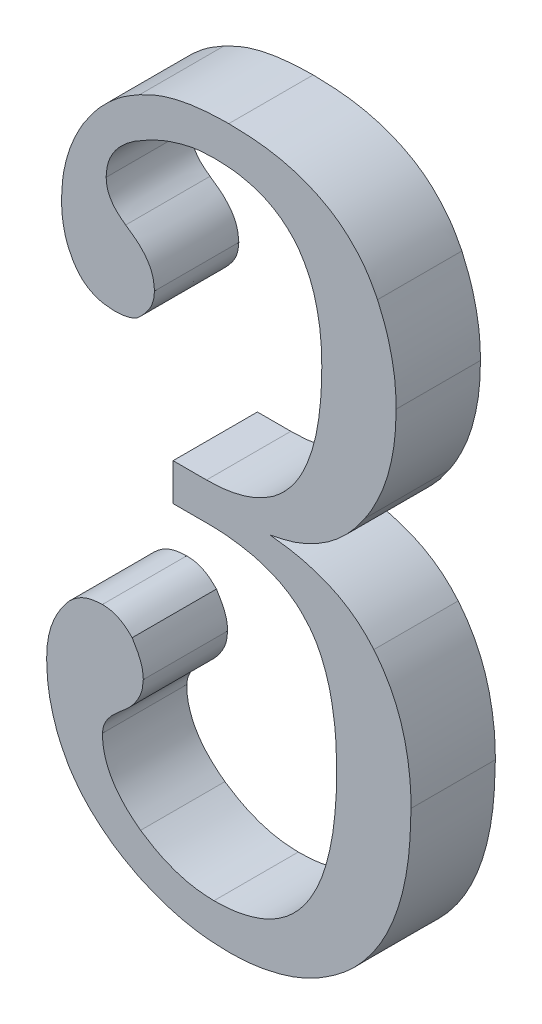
ISO-10303-21;
HEADER;
FILE_DESCRIPTION(('STEP AP214'),'2;1');
FILE_NAME('part.step','',(''),(''),'','','');
FILE_SCHEMA(('AUTOMOTIVE_DESIGN { 1 0 10303 214 1 1 1 1 }'));
ENDSEC;
DATA;
#1=APPLICATION_CONTEXT('core data for automotive mechanical design processes');
#2=APPLICATION_PROTOCOL_DEFINITION('international standard','automotive_design',2000,#1);
#3=PRODUCT_CONTEXT('',#1,'mechanical');
#4=PRODUCT('Part','Part','',(#3));
#5=PRODUCT_RELATED_PRODUCT_CATEGORY('part','',(#4));
#6=PRODUCT_DEFINITION_FORMATION('','',#4);
#7=PRODUCT_DEFINITION_CONTEXT('part definition',#1,'design');
#8=PRODUCT_DEFINITION('design','',#6,#7);
#9=PRODUCT_DEFINITION_SHAPE('','',#8);
#10=(LENGTH_UNIT() NAMED_UNIT(*) SI_UNIT(.MILLI.,.METRE.));
#11=(NAMED_UNIT(*) PLANE_ANGLE_UNIT() SI_UNIT($,.RADIAN.));
#12=(NAMED_UNIT(*) SI_UNIT($,.STERADIAN.) SOLID_ANGLE_UNIT());
#13=UNCERTAINTY_MEASURE_WITH_UNIT(LENGTH_MEASURE(1.E-05),#10,'distance_accuracy_value','');
#14=(GEOMETRIC_REPRESENTATION_CONTEXT(3) GLOBAL_UNCERTAINTY_ASSIGNED_CONTEXT((#13)) GLOBAL_UNIT_ASSIGNED_CONTEXT((#10,
#11,#12)) REPRESENTATION_CONTEXT('',''));
#15=CARTESIAN_POINT('',(0.,0.,0.));
#16=DIRECTION('',(0.,0.,1.));
#17=DIRECTION('',(1.,0.,0.));
#18=AXIS2_PLACEMENT_3D('',#15,#16,#17);
#19=CARTESIAN_POINT('',(5.29100529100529,23.2461297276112,3.));
#20=CARTESIAN_POINT('',(5.50704095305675,23.3542250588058,3.));
#21=CARTESIAN_POINT('',(5.9564248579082,23.5790782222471,3.));
#22=CARTESIAN_POINT('',(6.71549801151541,23.7916125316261,3.));
#23=CARTESIAN_POINT('',(7.56143476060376,23.918386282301,3.));
#24=CARTESIAN_POINT('',(8.15482367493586,23.9337514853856,3.));
#25=CARTESIAN_POINT('',(8.46560846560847,23.9417989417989,3.));
#26=B_SPLINE_CURVE_WITH_KNOTS('',3,(#19,#20,#21,#22,#23,#24,#25),.UNSPECIFIED.,.F.,.F.,(4,1,1,1,
4),(0.,0.220269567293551,0.458191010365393,0.716229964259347,1.),.UNSPECIFIED.);
#27=DIRECTION('',(0.,0.,-1.));
#28=VECTOR('',#27,1.);
#29=SURFACE_OF_LINEAR_EXTRUSION('',#26,#28);
#30=CARTESIAN_POINT('',(5.29100529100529,23.2461297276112,0.));
#31=CARTESIAN_POINT('',(5.50704095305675,23.3542250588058,0.));
#32=CARTESIAN_POINT('',(5.9564248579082,23.5790782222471,0.));
#33=CARTESIAN_POINT('',(6.71549801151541,23.7916125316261,0.));
#34=CARTESIAN_POINT('',(7.56143476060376,23.918386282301,0.));
#35=CARTESIAN_POINT('',(8.15482367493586,23.9337514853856,0.));
#36=CARTESIAN_POINT('',(8.46560846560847,23.9417989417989,0.));
#37=B_SPLINE_CURVE_WITH_KNOTS('',3,(#30,#31,#32,#33,#34,#35,#36),.UNSPECIFIED.,.F.,.F.,(4,1,1,1,
4),(0.,0.220269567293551,0.458191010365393,0.716229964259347,1.),.UNSPECIFIED.);
#38=CARTESIAN_POINT('',(5.29100529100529,23.2461297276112,0.));
#39=VERTEX_POINT('',#38);
#40=CARTESIAN_POINT('',(8.46560846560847,23.9417989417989,0.));
#41=VERTEX_POINT('',#40);
#42=EDGE_CURVE('E587',#39,#41,#37,.T.);
#43=ORIENTED_EDGE('',*,*,#42,.F.);
#44=DIRECTION('',(0.,0.,-1.));
#45=VECTOR('',#44,1.);
#46=CARTESIAN_POINT('',(5.29100529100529,23.2461297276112,3.));
#47=LINE('',#46,#45);
#48=CARTESIAN_POINT('',(5.29100529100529,23.2461297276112,3.));
#49=VERTEX_POINT('',#48);
#50=EDGE_CURVE('E11',#49,#39,#47,.T.);
#51=ORIENTED_EDGE('',*,*,#50,.F.);
#52=CARTESIAN_POINT('',(8.46560846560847,23.9417989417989,3.));
#53=VERTEX_POINT('',#52);
#54=EDGE_CURVE('E617',#49,#53,#26,.T.);
#55=ORIENTED_EDGE('',*,*,#54,.T.);
#56=DIRECTION('',(0.,0.,-1.));
#57=VECTOR('',#56,1.);
#58=CARTESIAN_POINT('',(8.46560846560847,23.9417989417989,3.));
#59=LINE('',#58,#57);
#60=EDGE_CURVE('E43',#53,#41,#59,.T.);
#61=ORIENTED_EDGE('',*,*,#60,.T.);
#62=EDGE_LOOP('',(#43,#51,#55,#61));
#63=FACE_BOUND('',#62,.T.);
#64=ADVANCED_FACE('F39',(#63),#29,.T.);
#65=CARTESIAN_POINT('',(3.27258475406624,21.3305898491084,3.));
#66=CARTESIAN_POINT('',(3.40450506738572,21.5305566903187,3.));
#67=CARTESIAN_POINT('',(3.66582849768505,21.9266747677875,3.));
#68=CARTESIAN_POINT('',(4.14643688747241,22.4456715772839,3.));
#69=CARTESIAN_POINT('',(4.68422560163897,22.8975205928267,3.));
#70=CARTESIAN_POINT('',(5.08786809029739,23.1294226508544,3.));
#71=CARTESIAN_POINT('',(5.29100529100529,23.2461297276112,3.));
#72=B_SPLINE_CURVE_WITH_KNOTS('',3,(#65,#66,#67,#68,#69,#70,#71),.UNSPECIFIED.,.F.,.F.,(4,1,1,1,
4),(0.,0.254866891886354,0.504870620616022,0.750821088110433,1.),.UNSPECIFIED.);
#73=DIRECTION('',(0.,0.,-1.));
#74=VECTOR('',#73,1.);
#75=SURFACE_OF_LINEAR_EXTRUSION('',#72,#74);
#76=CARTESIAN_POINT('',(3.27258475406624,21.3305898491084,0.));
#77=CARTESIAN_POINT('',(3.40450506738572,21.5305566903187,0.));
#78=CARTESIAN_POINT('',(3.66582849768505,21.9266747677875,0.));
#79=CARTESIAN_POINT('',(4.14643688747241,22.4456715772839,0.));
#80=CARTESIAN_POINT('',(4.68422560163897,22.8975205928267,0.));
#81=CARTESIAN_POINT('',(5.08786809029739,23.1294226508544,0.));
#82=CARTESIAN_POINT('',(5.29100529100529,23.2461297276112,0.));
#83=B_SPLINE_CURVE_WITH_KNOTS('',3,(#76,#77,#78,#79,#80,#81,#82),.UNSPECIFIED.,.F.,.F.,(4,1,1,1,
4),(0.,0.254866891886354,0.504870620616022,0.750821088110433,1.),.UNSPECIFIED.);
#84=CARTESIAN_POINT('',(3.27258475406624,21.3305898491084,0.));
#85=VERTEX_POINT('',#84);
#86=EDGE_CURVE('E615',#85,#39,#83,.T.);
#87=ORIENTED_EDGE('',*,*,#86,.F.);
#88=DIRECTION('',(0.,0.,-1.));
#89=VECTOR('',#88,1.);
#90=CARTESIAN_POINT('',(3.27258475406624,21.3305898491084,3.));
#91=LINE('',#90,#89);
#92=CARTESIAN_POINT('',(3.27258475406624,21.3305898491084,3.));
#93=VERTEX_POINT('',#92);
#94=EDGE_CURVE('E50',#93,#85,#91,.T.);
#95=ORIENTED_EDGE('',*,*,#94,.F.);
#96=EDGE_CURVE('E309',#93,#49,#72,.T.);
#97=ORIENTED_EDGE('',*,*,#96,.T.);
#98=ORIENTED_EDGE('',*,*,#50,.T.);
#99=EDGE_LOOP('',(#87,#95,#97,#98));
#100=FACE_BOUND('',#99,.T.);
#101=ADVANCED_FACE('F594',(#100),#75,.T.);
#102=CARTESIAN_POINT('',(2.51322751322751,18.6507936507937,3.));
#103=CARTESIAN_POINT('',(2.52284606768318,18.8818298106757,3.));
#104=CARTESIAN_POINT('',(2.54206004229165,19.3433464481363,3.));
#105=CARTESIAN_POINT('',(2.69214014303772,20.0249804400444,3.));
#106=CARTESIAN_POINT('',(2.92534099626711,20.6964190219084,3.));
#107=CARTESIAN_POINT('',(3.15524058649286,21.1162843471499,3.));
#108=CARTESIAN_POINT('',(3.27258475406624,21.3305898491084,3.));
#109=B_SPLINE_CURVE_WITH_KNOTS('',3,(#102,#103,#104,#105,#106,#107,#108),.UNSPECIFIED.,.F.,.F.,
(4,1,1,1,4),(0.,0.245823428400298,0.491055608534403,0.740227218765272,1.),.UNSPECIFIED.);
#110=DIRECTION('',(0.,0.,-1.));
#111=VECTOR('',#110,1.);
#112=SURFACE_OF_LINEAR_EXTRUSION('',#109,#111);
#113=CARTESIAN_POINT('',(2.51322751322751,18.6507936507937,0.));
#114=CARTESIAN_POINT('',(2.52284606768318,18.8818298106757,0.));
#115=CARTESIAN_POINT('',(2.54206004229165,19.3433464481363,0.));
#116=CARTESIAN_POINT('',(2.69214014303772,20.0249804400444,0.));
#117=CARTESIAN_POINT('',(2.92534099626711,20.6964190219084,0.));
#118=CARTESIAN_POINT('',(3.15524058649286,21.1162843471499,0.));
#119=CARTESIAN_POINT('',(3.27258475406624,21.3305898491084,0.));
#120=B_SPLINE_CURVE_WITH_KNOTS('',3,(#113,#114,#115,#116,#117,#118,#119),.UNSPECIFIED.,.F.,.F.,
(4,1,1,1,4),(0.,0.245823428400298,0.491055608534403,0.740227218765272,1.),.UNSPECIFIED.);
#121=CARTESIAN_POINT('',(2.51322751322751,18.6507936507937,0.));
#122=VERTEX_POINT('',#121);
#123=EDGE_CURVE('E295',#122,#85,#120,.T.);
#124=ORIENTED_EDGE('',*,*,#123,.F.);
#125=DIRECTION('',(0.,0.,-1.));
#126=VECTOR('',#125,1.);
#127=CARTESIAN_POINT('',(2.51322751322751,18.6507936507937,3.));
#128=LINE('',#127,#126);
#129=CARTESIAN_POINT('',(2.51322751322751,18.6507936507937,3.));
#130=VERTEX_POINT('',#129);
#131=EDGE_CURVE('E290',#130,#122,#128,.T.);
#132=ORIENTED_EDGE('',*,*,#131,.F.);
#133=EDGE_CURVE('E293',#130,#93,#109,.T.);
#134=ORIENTED_EDGE('',*,*,#133,.T.);
#135=ORIENTED_EDGE('',*,*,#94,.T.);
#136=EDGE_LOOP('',(#124,#132,#134,#135));
#137=FACE_BOUND('',#136,.T.);
#138=ADVANCED_FACE('F292',(#137),#112,.T.);
#139=CARTESIAN_POINT('',(2.91005291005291,16.965510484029,3.));
#140=CARTESIAN_POINT('',(2.84930488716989,17.0815332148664,3.));
#141=CARTESIAN_POINT('',(2.72328096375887,17.3222264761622,3.));
#142=CARTESIAN_POINT('',(2.59987875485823,17.7262626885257,3.));
#143=CARTESIAN_POINT('',(2.52551160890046,18.1744309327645,3.));
#144=CARTESIAN_POINT('',(2.51744700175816,18.4871668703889,3.));
#145=CARTESIAN_POINT('',(2.51322751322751,18.6507936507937,3.));
#146=B_SPLINE_CURVE_WITH_KNOTS('',3,(#139,#140,#141,#142,#143,#144,#145),.UNSPECIFIED.,.F.,.F.,
(4,1,1,1,4),(0.,0.22396743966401,0.464628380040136,0.719887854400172,1.),.UNSPECIFIED.);
#147=DIRECTION('',(0.,0.,-1.));
#148=VECTOR('',#147,1.);
#149=SURFACE_OF_LINEAR_EXTRUSION('',#146,#148);
#150=CARTESIAN_POINT('',(2.91005291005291,16.965510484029,0.));
#151=CARTESIAN_POINT('',(2.84930488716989,17.0815332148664,0.));
#152=CARTESIAN_POINT('',(2.72328096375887,17.3222264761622,0.));
#153=CARTESIAN_POINT('',(2.59987875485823,17.7262626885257,0.));
#154=CARTESIAN_POINT('',(2.52551160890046,18.1744309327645,0.));
#155=CARTESIAN_POINT('',(2.51744700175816,18.4871668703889,0.));
#156=CARTESIAN_POINT('',(2.51322751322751,18.6507936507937,0.));
#157=B_SPLINE_CURVE_WITH_KNOTS('',3,(#150,#151,#152,#153,#154,#155,#156),.UNSPECIFIED.,.F.,.F.,
(4,1,1,1,4),(0.,0.22396743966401,0.464628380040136,0.719887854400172,1.),.UNSPECIFIED.);
#158=CARTESIAN_POINT('',(2.91005291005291,16.965510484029,0.));
#159=VERTEX_POINT('',#158);
#160=EDGE_CURVE('E622',#159,#122,#157,.T.);
#161=ORIENTED_EDGE('',*,*,#160,.F.);
#162=DIRECTION('',(0.,0.,-1.));
#163=VECTOR('',#162,1.);
#164=CARTESIAN_POINT('',(2.91005291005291,16.965510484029,3.));
#165=LINE('',#164,#163);
#166=CARTESIAN_POINT('',(2.91005291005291,16.965510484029,3.));
#167=VERTEX_POINT('',#166);
#168=EDGE_CURVE('E301',#167,#159,#165,.T.);
#169=ORIENTED_EDGE('',*,*,#168,.F.);
#170=EDGE_CURVE('E307',#167,#130,#146,.T.);
#171=ORIENTED_EDGE('',*,*,#170,.T.);
#172=ORIENTED_EDGE('',*,*,#131,.T.);
#173=EDGE_LOOP('',(#161,#169,#171,#172));
#174=FACE_BOUND('',#173,.T.);
#175=ADVANCED_FACE('F312',(#174),#149,.T.);
#176=CARTESIAN_POINT('',(4.36507936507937,16.1375661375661,3.));
#177=CARTESIAN_POINT('',(4.21334071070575,16.1475962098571,3.));
#178=CARTESIAN_POINT('',(3.92109618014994,16.1669138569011,3.));
#179=CARTESIAN_POINT('',(3.51119949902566,16.326974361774,3.));
#180=CARTESIAN_POINT('',(3.15950551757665,16.5936332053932,3.));
#181=CARTESIAN_POINT('',(2.99497140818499,16.8389162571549,3.));
#182=CARTESIAN_POINT('',(2.91005291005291,16.965510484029,3.));
#183=B_SPLINE_CURVE_WITH_KNOTS('',3,(#176,#177,#178,#179,#180,#181,#182),.UNSPECIFIED.,.F.,.F.,
(4,1,1,1,4),(0.,0.258627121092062,0.498108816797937,0.740966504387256,1.),.UNSPECIFIED.);
#184=DIRECTION('',(0.,0.,-1.));
#185=VECTOR('',#184,1.);
#186=SURFACE_OF_LINEAR_EXTRUSION('',#183,#185);
#187=CARTESIAN_POINT('',(4.36507936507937,16.1375661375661,0.));
#188=CARTESIAN_POINT('',(4.21334071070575,16.1475962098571,0.));
#189=CARTESIAN_POINT('',(3.92109618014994,16.1669138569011,0.));
#190=CARTESIAN_POINT('',(3.51119949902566,16.326974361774,0.));
#191=CARTESIAN_POINT('',(3.15950551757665,16.5936332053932,0.));
#192=CARTESIAN_POINT('',(2.99497140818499,16.8389162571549,0.));
#193=CARTESIAN_POINT('',(2.91005291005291,16.965510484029,0.));
#194=B_SPLINE_CURVE_WITH_KNOTS('',3,(#187,#188,#189,#190,#191,#192,#193),.UNSPECIFIED.,.F.,.F.,
(4,1,1,1,4),(0.,0.258627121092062,0.498108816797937,0.740966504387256,1.),.UNSPECIFIED.);
#195=CARTESIAN_POINT('',(4.36507936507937,16.1375661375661,0.));
#196=VERTEX_POINT('',#195);
#197=EDGE_CURVE('E713',#196,#159,#194,.T.);
#198=ORIENTED_EDGE('',*,*,#197,.F.);
#199=DIRECTION('',(0.,0.,-1.));
#200=VECTOR('',#199,1.);
#201=CARTESIAN_POINT('',(4.36507936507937,16.1375661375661,3.));
#202=LINE('',#201,#200);
#203=CARTESIAN_POINT('',(4.36507936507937,16.1375661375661,3.));
#204=VERTEX_POINT('',#203);
#205=EDGE_CURVE('E637',#204,#196,#202,.T.);
#206=ORIENTED_EDGE('',*,*,#205,.F.);
#207=EDGE_CURVE('E314',#204,#167,#183,.T.);
#208=ORIENTED_EDGE('',*,*,#207,.T.);
#209=ORIENTED_EDGE('',*,*,#168,.T.);
#210=EDGE_LOOP('',(#198,#206,#208,#209));
#211=FACE_BOUND('',#210,.T.);
#212=ADVANCED_FACE('F337',(#211),#186,.T.);
#213=CARTESIAN_POINT('',(5.35959239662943,16.4707035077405,3.));
#214=CARTESIAN_POINT('',(5.30848221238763,16.4178306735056,3.));
#215=CARTESIAN_POINT('',(5.20046228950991,16.3060854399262,3.));
#216=CARTESIAN_POINT('',(4.96659183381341,16.2099334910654,3.));
#217=CARTESIAN_POINT('',(4.68577814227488,16.1438569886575,3.));
#218=CARTESIAN_POINT('',(4.47832928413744,16.1397876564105,3.));
#219=CARTESIAN_POINT('',(4.36507936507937,16.1375661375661,3.));
#220=B_SPLINE_CURVE_WITH_KNOTS('',3,(#213,#214,#215,#216,#217,#218,#219),.UNSPECIFIED.,.F.,.F.,
(4,1,1,1,4),(0.,0.201927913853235,0.426768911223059,0.687063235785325,1.),.UNSPECIFIED.);
#221=DIRECTION('',(0.,0.,-1.));
#222=VECTOR('',#221,1.);
#223=SURFACE_OF_LINEAR_EXTRUSION('',#220,#222);
#224=CARTESIAN_POINT('',(5.35959239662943,16.4707035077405,0.));
#225=CARTESIAN_POINT('',(5.30848221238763,16.4178306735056,0.));
#226=CARTESIAN_POINT('',(5.20046228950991,16.3060854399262,0.));
#227=CARTESIAN_POINT('',(4.96659183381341,16.2099334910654,0.));
#228=CARTESIAN_POINT('',(4.68577814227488,16.1438569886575,0.));
#229=CARTESIAN_POINT('',(4.47832928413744,16.1397876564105,0.));
#230=CARTESIAN_POINT('',(4.36507936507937,16.1375661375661,0.));
#231=B_SPLINE_CURVE_WITH_KNOTS('',3,(#224,#225,#226,#227,#228,#229,#230),.UNSPECIFIED.,.F.,.F.,
(4,1,1,1,4),(0.,0.201927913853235,0.426768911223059,0.687063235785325,1.),.UNSPECIFIED.);
#232=CARTESIAN_POINT('',(5.35959239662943,16.4707035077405,0.));
#233=VERTEX_POINT('',#232);
#234=EDGE_CURVE('E704',#233,#196,#231,.T.);
#235=ORIENTED_EDGE('',*,*,#234,.F.);
#236=DIRECTION('',(0.,0.,-1.));
#237=VECTOR('',#236,1.);
#238=CARTESIAN_POINT('',(5.35959239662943,16.4707035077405,3.));
#239=LINE('',#238,#237);
#240=CARTESIAN_POINT('',(5.35959239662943,16.4707035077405,3.));
#241=VERTEX_POINT('',#240);
#242=EDGE_CURVE('E640',#241,#233,#239,.T.);
#243=ORIENTED_EDGE('',*,*,#242,.F.);
#244=EDGE_CURVE('E317',#241,#204,#220,.T.);
#245=ORIENTED_EDGE('',*,*,#244,.T.);
#246=ORIENTED_EDGE('',*,*,#205,.T.);
#247=EDGE_LOOP('',(#235,#243,#245,#246));
#248=FACE_BOUND('',#247,.T.);
#249=ADVANCED_FACE('F341',(#248),#223,.T.);
#250=CARTESIAN_POINT('',(5.82010582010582,17.4603174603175,3.));
#251=CARTESIAN_POINT('',(5.81404654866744,17.373127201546,3.));
#252=CARTESIAN_POINT('',(5.80188027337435,17.1980598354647,3.));
#253=CARTESIAN_POINT('',(5.71324862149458,16.9396288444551,3.));
#254=CARTESIAN_POINT('',(5.56325517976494,16.6935838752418,3.));
#255=CARTESIAN_POINT('',(5.42925194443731,16.5469361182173,3.));
#256=CARTESIAN_POINT('',(5.35959239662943,16.4707035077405,3.));
#257=B_SPLINE_CURVE_WITH_KNOTS('',3,(#250,#251,#252,#253,#254,#255,#256),.UNSPECIFIED.,.F.,.F.,
(4,1,1,1,4),(0.,0.233394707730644,0.468628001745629,0.723774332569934,1.),.UNSPECIFIED.);
#258=DIRECTION('',(0.,0.,-1.));
#259=VECTOR('',#258,1.);
#260=SURFACE_OF_LINEAR_EXTRUSION('',#257,#259);
#261=CARTESIAN_POINT('',(5.82010582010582,17.4603174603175,0.));
#262=CARTESIAN_POINT('',(5.81404654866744,17.373127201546,0.));
#263=CARTESIAN_POINT('',(5.80188027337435,17.1980598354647,0.));
#264=CARTESIAN_POINT('',(5.71324862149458,16.9396288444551,0.));
#265=CARTESIAN_POINT('',(5.56325517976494,16.6935838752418,0.));
#266=CARTESIAN_POINT('',(5.42925194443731,16.5469361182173,0.));
#267=CARTESIAN_POINT('',(5.35959239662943,16.4707035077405,0.));
#268=B_SPLINE_CURVE_WITH_KNOTS('',3,(#261,#262,#263,#264,#265,#266,#267),.UNSPECIFIED.,.F.,.F.,
(4,1,1,1,4),(0.,0.233394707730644,0.468628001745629,0.723774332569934,1.),.UNSPECIFIED.);
#269=CARTESIAN_POINT('',(5.82010582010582,17.4603174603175,0.));
#270=VERTEX_POINT('',#269);
#271=EDGE_CURVE('E695',#270,#233,#268,.T.);
#272=ORIENTED_EDGE('',*,*,#271,.F.);
#273=DIRECTION('',(0.,0.,-1.));
#274=VECTOR('',#273,1.);
#275=CARTESIAN_POINT('',(5.82010582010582,17.4603174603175,3.));
#276=LINE('',#275,#274);
#277=CARTESIAN_POINT('',(5.82010582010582,17.4603174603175,3.));
#278=VERTEX_POINT('',#277);
#279=EDGE_CURVE('E643',#278,#270,#276,.T.);
#280=ORIENTED_EDGE('',*,*,#279,.F.);
#281=EDGE_CURVE('E354',#278,#241,#257,.T.);
#282=ORIENTED_EDGE('',*,*,#281,.T.);
#283=ORIENTED_EDGE('',*,*,#242,.T.);
#284=EDGE_LOOP('',(#272,#280,#282,#283));
#285=FACE_BOUND('',#284,.T.);
#286=ADVANCED_FACE('F345',(#285),#260,.T.);
#287=CARTESIAN_POINT('',(4.79619831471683,18.9839310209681,3.));
#288=CARTESIAN_POINT('',(4.9496214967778,18.8787511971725,3.));
#289=CARTESIAN_POINT('',(5.23696081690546,18.6817646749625,3.));
#290=CARTESIAN_POINT('',(5.57359682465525,18.313733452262,3.));
#291=CARTESIAN_POINT('',(5.78371596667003,17.8996764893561,3.));
#292=CARTESIAN_POINT('',(5.80801866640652,17.6062537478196,3.));
#293=CARTESIAN_POINT('',(5.82010582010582,17.4603174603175,3.));
#294=B_SPLINE_CURVE_WITH_KNOTS('',3,(#287,#288,#289,#290,#291,#292,#293),.UNSPECIFIED.,.F.,.F.,
(4,1,1,1,4),(0.,0.290083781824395,0.543284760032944,0.772848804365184,1.),.UNSPECIFIED.);
#295=DIRECTION('',(0.,0.,-1.));
#296=VECTOR('',#295,1.);
#297=SURFACE_OF_LINEAR_EXTRUSION('',#294,#296);
#298=CARTESIAN_POINT('',(4.79619831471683,18.9839310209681,0.));
#299=CARTESIAN_POINT('',(4.9496214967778,18.8787511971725,0.));
#300=CARTESIAN_POINT('',(5.23696081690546,18.6817646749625,0.));
#301=CARTESIAN_POINT('',(5.57359682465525,18.313733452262,0.));
#302=CARTESIAN_POINT('',(5.78371596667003,17.8996764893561,0.));
#303=CARTESIAN_POINT('',(5.80801866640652,17.6062537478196,0.));
#304=CARTESIAN_POINT('',(5.82010582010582,17.4603174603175,0.));
#305=B_SPLINE_CURVE_WITH_KNOTS('',3,(#298,#299,#300,#301,#302,#303,#304),.UNSPECIFIED.,.F.,.F.,
(4,1,1,1,4),(0.,0.290083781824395,0.543284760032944,0.772848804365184,1.),.UNSPECIFIED.);
#306=CARTESIAN_POINT('',(4.79619831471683,18.9839310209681,0.));
#307=VERTEX_POINT('',#306);
#308=EDGE_CURVE('E686',#307,#270,#305,.T.);
#309=ORIENTED_EDGE('',*,*,#308,.F.);
#310=DIRECTION('',(0.,0.,-1.));
#311=VECTOR('',#310,1.);
#312=CARTESIAN_POINT('',(4.79619831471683,18.9839310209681,3.));
#313=LINE('',#312,#311);
#314=CARTESIAN_POINT('',(4.79619831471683,18.9839310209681,3.));
#315=VERTEX_POINT('',#314);
#316=EDGE_CURVE('E646',#315,#307,#313,.T.);
#317=ORIENTED_EDGE('',*,*,#316,.F.);
#318=EDGE_CURVE('E364',#315,#278,#294,.T.);
#319=ORIENTED_EDGE('',*,*,#318,.T.);
#320=ORIENTED_EDGE('',*,*,#279,.T.);
#321=EDGE_LOOP('',(#309,#317,#319,#320));
#322=FACE_BOUND('',#321,.T.);
#323=ADVANCED_FACE('F382',(#322),#297,.T.);
#324=CARTESIAN_POINT('',(4.1005291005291,20.1058201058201,3.));
#325=CARTESIAN_POINT('',(4.10879392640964,19.9981802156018,3.));
#326=CARTESIAN_POINT('',(4.12534562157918,19.7826133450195,3.));
#327=CARTESIAN_POINT('',(4.26908842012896,19.4802746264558,3.));
#328=CARTESIAN_POINT('',(4.49398545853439,19.2063417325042,3.));
#329=CARTESIAN_POINT('',(4.69106391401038,19.0613036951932,3.));
#330=CARTESIAN_POINT('',(4.79619831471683,18.9839310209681,3.));
#331=B_SPLINE_CURVE_WITH_KNOTS('',3,(#324,#325,#326,#327,#328,#329,#330),.UNSPECIFIED.,.F.,.F.,
(4,1,1,1,4),(0.,0.233755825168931,0.468135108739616,0.716268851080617,1.),.UNSPECIFIED.);
#332=DIRECTION('',(0.,0.,-1.));
#333=VECTOR('',#332,1.);
#334=SURFACE_OF_LINEAR_EXTRUSION('',#331,#333);
#335=CARTESIAN_POINT('',(4.1005291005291,20.1058201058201,0.));
#336=CARTESIAN_POINT('',(4.10879392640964,19.9981802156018,0.));
#337=CARTESIAN_POINT('',(4.12534562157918,19.7826133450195,0.));
#338=CARTESIAN_POINT('',(4.26908842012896,19.4802746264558,0.));
#339=CARTESIAN_POINT('',(4.49398545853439,19.2063417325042,0.));
#340=CARTESIAN_POINT('',(4.69106391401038,19.0613036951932,0.));
#341=CARTESIAN_POINT('',(4.79619831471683,18.9839310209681,0.));
#342=B_SPLINE_CURVE_WITH_KNOTS('',3,(#335,#336,#337,#338,#339,#340,#341),.UNSPECIFIED.,.F.,.F.,
(4,1,1,1,4),(0.,0.233755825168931,0.468135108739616,0.716268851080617,1.),.UNSPECIFIED.);
#343=CARTESIAN_POINT('',(4.1005291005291,20.1058201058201,0.));
#344=VERTEX_POINT('',#343);
#345=EDGE_CURVE('E661',#344,#307,#342,.T.);
#346=ORIENTED_EDGE('',*,*,#345,.F.);
#347=DIRECTION('',(0.,0.,-1.));
#348=VECTOR('',#347,1.);
#349=CARTESIAN_POINT('',(4.1005291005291,20.1058201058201,3.));
#350=LINE('',#349,#348);
#351=CARTESIAN_POINT('',(4.1005291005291,20.1058201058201,3.));
#352=VERTEX_POINT('',#351);
#353=EDGE_CURVE('E649',#352,#344,#350,.T.);
#354=ORIENTED_EDGE('',*,*,#353,.F.);
#355=EDGE_CURVE('E374',#352,#315,#331,.T.);
#356=ORIENTED_EDGE('',*,*,#355,.T.);
#357=ORIENTED_EDGE('',*,*,#316,.T.);
#358=EDGE_LOOP('',(#346,#354,#356,#357));
#359=FACE_BOUND('',#358,.T.);
#360=ADVANCED_FACE('F385',(#359),#334,.T.);
#361=CARTESIAN_POINT('',(5.52126200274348,21.957671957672,3.));
#362=CARTESIAN_POINT('',(5.40890578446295,21.8978511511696,3.));
#363=CARTESIAN_POINT('',(5.19292008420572,21.7828558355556,3.));
#364=CARTESIAN_POINT('',(4.90185730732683,21.5809280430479,3.));
#365=CARTESIAN_POINT('',(4.65737821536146,21.3667964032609,3.));
#366=CARTESIAN_POINT('',(4.45375849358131,21.1415012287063,3.));
#367=CARTESIAN_POINT('',(4.29762835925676,20.9015446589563,3.));
#368=CARTESIAN_POINT('',(4.18013839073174,20.6484918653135,3.));
#369=CARTESIAN_POINT('',(4.11712501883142,20.379912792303,3.));
#370=CARTESIAN_POINT('',(4.10608346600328,20.1975541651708,3.));
#371=CARTESIAN_POINT('',(4.1005291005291,20.1058201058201,3.));
#372=B_SPLINE_CURVE_WITH_KNOTS('',3,(#361,#362,#363,#364,#365,#366,#367,#368,#369,#370,#371),
.UNSPECIFIED.,.F.,.F.,(4,1,1,1,1,1,1,1,4),(0.,0.154929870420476,0.297826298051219,
0.430293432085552,0.550040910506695,0.666438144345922,0.777709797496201,0.888178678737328,1.),.UNSPECIFIED.);
#373=DIRECTION('',(0.,0.,-1.));
#374=VECTOR('',#373,1.);
#375=SURFACE_OF_LINEAR_EXTRUSION('',#372,#374);
#376=CARTESIAN_POINT('',(5.52126200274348,21.957671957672,0.));
#377=CARTESIAN_POINT('',(5.40890578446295,21.8978511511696,0.));
#378=CARTESIAN_POINT('',(5.19292008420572,21.7828558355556,0.));
#379=CARTESIAN_POINT('',(4.90185730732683,21.5809280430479,0.));
#380=CARTESIAN_POINT('',(4.65737821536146,21.3667964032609,0.));
#381=CARTESIAN_POINT('',(4.45375849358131,21.1415012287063,0.));
#382=CARTESIAN_POINT('',(4.29762835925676,20.9015446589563,0.));
#383=CARTESIAN_POINT('',(4.18013839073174,20.6484918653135,0.));
#384=CARTESIAN_POINT('',(4.11712501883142,20.379912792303,0.));
#385=CARTESIAN_POINT('',(4.10608346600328,20.1975541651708,0.));
#386=CARTESIAN_POINT('',(4.1005291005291,20.1058201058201,0.));
#387=B_SPLINE_CURVE_WITH_KNOTS('',3,(#376,#377,#378,#379,#380,#381,#382,#383,#384,#385,#386),
.UNSPECIFIED.,.F.,.F.,(4,1,1,1,1,1,1,1,4),(0.,0.154929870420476,0.297826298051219,
0.430293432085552,0.550040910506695,0.666438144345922,0.777709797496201,0.888178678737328,1.),.UNSPECIFIED.);
#388=CARTESIAN_POINT('',(5.52126200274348,21.957671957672,0.));
#389=VERTEX_POINT('',#388);
#390=EDGE_CURVE('E657',#389,#344,#387,.T.);
#391=ORIENTED_EDGE('',*,*,#390,.F.);
#392=DIRECTION('',(0.,0.,-1.));
#393=VECTOR('',#392,1.);
#394=CARTESIAN_POINT('',(5.52126200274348,21.957671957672,3.));
#395=LINE('',#394,#393);
#396=CARTESIAN_POINT('',(5.52126200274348,21.957671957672,3.));
#397=VERTEX_POINT('',#396);
#398=EDGE_CURVE('E505',#397,#389,#395,.T.);
#399=ORIENTED_EDGE('',*,*,#398,.F.);
#400=EDGE_CURVE('E397',#397,#352,#372,.T.);
#401=ORIENTED_EDGE('',*,*,#400,.T.);
#402=ORIENTED_EDGE('',*,*,#353,.T.);
#403=EDGE_LOOP('',(#391,#399,#401,#402));
#404=FACE_BOUND('',#403,.T.);
#405=ADVANCED_FACE('F389',(#404),#375,.T.);
#406=CARTESIAN_POINT('',(7.93650793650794,22.6190476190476,3.));
#407=CARTESIAN_POINT('',(7.73160725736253,22.612519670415,3.));
#408=CARTESIAN_POINT('',(7.32104980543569,22.5994396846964,3.));
#409=CARTESIAN_POINT('',(6.71199541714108,22.4600914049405,3.));
#410=CARTESIAN_POINT('',(6.10386225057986,22.2589597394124,3.));
#411=CARTESIAN_POINT('',(5.71814715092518,22.0594897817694,3.));
#412=CARTESIAN_POINT('',(5.52126200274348,21.957671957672,3.));
#413=B_SPLINE_CURVE_WITH_KNOTS('',3,(#406,#407,#408,#409,#410,#411,#412),.UNSPECIFIED.,.F.,.F.,
(4,1,1,1,4),(0.,0.242525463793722,0.48594585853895,0.737605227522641,1.),.UNSPECIFIED.);
#414=DIRECTION('',(0.,0.,-1.));
#415=VECTOR('',#414,1.);
#416=SURFACE_OF_LINEAR_EXTRUSION('',#413,#415);
#417=CARTESIAN_POINT('',(7.93650793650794,22.6190476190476,0.));
#418=CARTESIAN_POINT('',(7.73160725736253,22.612519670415,0.));
#419=CARTESIAN_POINT('',(7.32104980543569,22.5994396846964,0.));
#420=CARTESIAN_POINT('',(6.71199541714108,22.4600914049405,0.));
#421=CARTESIAN_POINT('',(6.10386225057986,22.2589597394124,0.));
#422=CARTESIAN_POINT('',(5.71814715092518,22.0594897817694,0.));
#423=CARTESIAN_POINT('',(5.52126200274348,21.957671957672,0.));
#424=B_SPLINE_CURVE_WITH_KNOTS('',3,(#417,#418,#419,#420,#421,#422,#423),.UNSPECIFIED.,.F.,.F.,
(4,1,1,1,4),(0.,0.242525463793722,0.48594585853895,0.737605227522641,1.),.UNSPECIFIED.);
#425=CARTESIAN_POINT('',(7.93650793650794,22.6190476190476,0.));
#426=VERTEX_POINT('',#425);
#427=EDGE_CURVE('E655',#426,#389,#424,.T.);
#428=ORIENTED_EDGE('',*,*,#427,.F.);
#429=DIRECTION('',(0.,0.,-1.));
#430=VECTOR('',#429,1.);
#431=CARTESIAN_POINT('',(7.93650793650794,22.6190476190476,3.));
#432=LINE('',#431,#430);
#433=CARTESIAN_POINT('',(7.93650793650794,22.6190476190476,3.));
#434=VERTEX_POINT('',#433);
#435=EDGE_CURVE('E496',#434,#426,#432,.T.);
#436=ORIENTED_EDGE('',*,*,#435,.F.);
#437=EDGE_CURVE('E403',#434,#397,#413,.T.);
#438=ORIENTED_EDGE('',*,*,#437,.T.);
#439=ORIENTED_EDGE('',*,*,#398,.T.);
#440=EDGE_LOOP('',(#428,#436,#438,#439));
#441=FACE_BOUND('',#440,.T.);
#442=ADVANCED_FACE('F393',(#441),#416,.T.);
#443=CARTESIAN_POINT('',(11.7724867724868,18.1216931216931,3.));
#444=CARTESIAN_POINT('',(11.7696741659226,18.30302678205,3.));
#445=CARTESIAN_POINT('',(11.7642174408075,18.6548313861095,3.));
#446=CARTESIAN_POINT('',(11.7219586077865,19.1660674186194,3.));
#447=CARTESIAN_POINT('',(11.6413540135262,19.6415979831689,3.));
#448=CARTESIAN_POINT('',(11.5414505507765,20.083175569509,3.));
#449=CARTESIAN_POINT('',(11.410016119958,20.4897265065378,3.));
#450=CARTESIAN_POINT('',(11.2407965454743,20.8592301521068,3.));
#451=CARTESIAN_POINT('',(11.0473040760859,21.1979682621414,3.));
#452=CARTESIAN_POINT('',(10.8210314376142,21.5002088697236,3.));
#453=CARTESIAN_POINT('',(10.561089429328,21.7616123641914,3.));
#454=CARTESIAN_POINT('',(10.2784038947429,21.9951191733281,3.));
#455=CARTESIAN_POINT('',(9.95881025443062,22.1847032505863,3.));
#456=CARTESIAN_POINT('',(9.61502304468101,22.3508715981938,3.));
#457=CARTESIAN_POINT('',(9.236253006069,22.4688097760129,3.));
#458=CARTESIAN_POINT('',(8.83030597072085,22.5601805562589,3.));
#459=CARTESIAN_POINT('',(8.39313808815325,22.6056646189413,3.));
#460=CARTESIAN_POINT('',(8.09172386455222,22.6144985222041,3.));
#461=CARTESIAN_POINT('',(7.93650793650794,22.6190476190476,3.));
#462=B_SPLINE_CURVE_WITH_KNOTS('',3,(#443,#444,#445,#446,#447,#448,#449,#450,#451,#452,#453,
#454,#455,#456,#457,#458,#459,#460,#461),.UNSPECIFIED.,.F.,.F.,(4,1,1,1,1,1,1,1,1,1,1,1,1,1,1,1,
4),(0.,0.0803603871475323,0.155906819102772,0.227054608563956,0.293937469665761,
0.356415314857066,0.416009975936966,0.473729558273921,0.529020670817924,0.582755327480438,
0.636781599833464,0.691020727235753,0.747027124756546,0.805615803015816,0.866372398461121,
0.931187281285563,1.),.UNSPECIFIED.);
#463=DIRECTION('',(0.,0.,-1.));
#464=VECTOR('',#463,1.);
#465=SURFACE_OF_LINEAR_EXTRUSION('',#462,#464);
#466=CARTESIAN_POINT('',(11.7724867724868,18.1216931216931,0.));
#467=CARTESIAN_POINT('',(11.7696741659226,18.30302678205,0.));
#468=CARTESIAN_POINT('',(11.7642174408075,18.6548313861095,0.));
#469=CARTESIAN_POINT('',(11.7219586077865,19.1660674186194,0.));
#470=CARTESIAN_POINT('',(11.6413540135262,19.6415979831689,0.));
#471=CARTESIAN_POINT('',(11.5414505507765,20.083175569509,0.));
#472=CARTESIAN_POINT('',(11.410016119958,20.4897265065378,0.));
#473=CARTESIAN_POINT('',(11.2407965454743,20.8592301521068,0.));
#474=CARTESIAN_POINT('',(11.0473040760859,21.1979682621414,0.));
#475=CARTESIAN_POINT('',(10.8210314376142,21.5002088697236,0.));
#476=CARTESIAN_POINT('',(10.561089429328,21.7616123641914,0.));
#477=CARTESIAN_POINT('',(10.2784038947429,21.9951191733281,0.));
#478=CARTESIAN_POINT('',(9.95881025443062,22.1847032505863,0.));
#479=CARTESIAN_POINT('',(9.61502304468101,22.3508715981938,0.));
#480=CARTESIAN_POINT('',(9.236253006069,22.4688097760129,0.));
#481=CARTESIAN_POINT('',(8.83030597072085,22.5601805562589,0.));
#482=CARTESIAN_POINT('',(8.39313808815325,22.6056646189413,0.));
#483=CARTESIAN_POINT('',(8.09172386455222,22.6144985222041,0.));
#484=CARTESIAN_POINT('',(7.93650793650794,22.6190476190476,0.));
#485=B_SPLINE_CURVE_WITH_KNOTS('',3,(#466,#467,#468,#469,#470,#471,#472,#473,#474,#475,#476,
#477,#478,#479,#480,#481,#482,#483,#484),.UNSPECIFIED.,.F.,.F.,(4,1,1,1,1,1,1,1,1,1,1,1,1,1,1,1,
4),(0.,0.0803603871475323,0.155906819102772,0.227054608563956,0.293937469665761,
0.356415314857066,0.416009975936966,0.473729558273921,0.529020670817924,0.582755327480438,
0.636781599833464,0.691020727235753,0.747027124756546,0.805615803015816,0.866372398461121,
0.931187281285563,1.),.UNSPECIFIED.);
#486=CARTESIAN_POINT('',(11.7724867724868,18.1216931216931,0.));
#487=VERTEX_POINT('',#486);
#488=EDGE_CURVE('E499',#487,#426,#485,.T.);
#489=ORIENTED_EDGE('',*,*,#488,.F.);
#490=DIRECTION('',(0.,0.,-1.));
#491=VECTOR('',#490,1.);
#492=CARTESIAN_POINT('',(11.7724867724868,18.1216931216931,3.));
#493=LINE('',#492,#491);
#494=CARTESIAN_POINT('',(11.7724867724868,18.1216931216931,3.));
#495=VERTEX_POINT('',#494);
#496=EDGE_CURVE('E489',#495,#487,#493,.T.);
#497=ORIENTED_EDGE('',*,*,#496,.F.);
#498=EDGE_CURVE('E413',#495,#434,#462,.T.);
#499=ORIENTED_EDGE('',*,*,#498,.T.);
#500=ORIENTED_EDGE('',*,*,#435,.T.);
#501=EDGE_LOOP('',(#489,#497,#499,#500));
#502=FACE_BOUND('',#501,.T.);
#503=ADVANCED_FACE('F431',(#502),#465,.T.);
#504=CARTESIAN_POINT('',(7.67195767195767,12.5661375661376,3.));
#505=CARTESIAN_POINT('',(7.83718277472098,12.5687705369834,3.));
#506=CARTESIAN_POINT('',(8.15937306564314,12.5739048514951,3.));
#507=CARTESIAN_POINT('',(8.62501476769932,12.6463514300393,3.));
#508=CARTESIAN_POINT('',(9.06094580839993,12.7522687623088,3.));
#509=CARTESIAN_POINT('',(9.46516629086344,12.9033573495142,3.));
#510=CARTESIAN_POINT('',(9.8347486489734,13.1030378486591,3.));
#511=CARTESIAN_POINT('',(10.1786052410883,13.3371795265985,3.));
#512=CARTESIAN_POINT('',(10.4828807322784,13.6267308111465,3.));
#513=CARTESIAN_POINT('',(10.7576017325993,13.9553297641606,3.));
#514=CARTESIAN_POINT('',(11.0000351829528,14.3266052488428,3.));
#515=CARTESIAN_POINT('',(11.2048253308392,14.7422988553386,3.));
#516=CARTESIAN_POINT('',(11.3806924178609,15.2000528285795,3.));
#517=CARTESIAN_POINT('',(11.5278364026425,15.7010858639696,3.));
#518=CARTESIAN_POINT('',(11.6390623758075,16.2452832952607,3.));
#519=CARTESIAN_POINT('',(11.7153212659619,16.833131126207,3.));
#520=CARTESIAN_POINT('',(11.7660321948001,17.462691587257,3.));
#521=CARTESIAN_POINT('',(11.7702944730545,17.897863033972,3.));
#522=CARTESIAN_POINT('',(11.7724867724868,18.1216931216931,3.));
#523=B_SPLINE_CURVE_WITH_KNOTS('',3,(#504,#505,#506,#507,#508,#509,#510,#511,#512,#513,#514,
#515,#516,#517,#518,#519,#520,#521,#522),.UNSPECIFIED.,.F.,.F.,(4,1,1,1,1,1,1,1,1,1,1,1,1,1,1,1,
4),(0.,0.0629326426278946,0.122719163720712,0.179194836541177,0.233775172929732,
0.286696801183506,0.339029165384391,0.391888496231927,0.446255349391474,0.502033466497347,
0.56050554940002,0.622594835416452,0.688790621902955,0.759368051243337,0.83412502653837,
0.914682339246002,1.),.UNSPECIFIED.);
#524=DIRECTION('',(0.,0.,-1.));
#525=VECTOR('',#524,1.);
#526=SURFACE_OF_LINEAR_EXTRUSION('',#523,#525);
#527=CARTESIAN_POINT('',(7.67195767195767,12.5661375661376,0.));
#528=CARTESIAN_POINT('',(7.83718277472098,12.5687705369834,0.));
#529=CARTESIAN_POINT('',(8.15937306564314,12.5739048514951,0.));
#530=CARTESIAN_POINT('',(8.62501476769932,12.6463514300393,0.));
#531=CARTESIAN_POINT('',(9.06094580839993,12.7522687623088,0.));
#532=CARTESIAN_POINT('',(9.46516629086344,12.9033573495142,0.));
#533=CARTESIAN_POINT('',(9.8347486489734,13.1030378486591,0.));
#534=CARTESIAN_POINT('',(10.1786052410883,13.3371795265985,0.));
#535=CARTESIAN_POINT('',(10.4828807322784,13.6267308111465,0.));
#536=CARTESIAN_POINT('',(10.7576017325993,13.9553297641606,0.));
#537=CARTESIAN_POINT('',(11.0000351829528,14.3266052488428,0.));
#538=CARTESIAN_POINT('',(11.2048253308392,14.7422988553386,0.));
#539=CARTESIAN_POINT('',(11.3806924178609,15.2000528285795,0.));
#540=CARTESIAN_POINT('',(11.5278364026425,15.7010858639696,0.));
#541=CARTESIAN_POINT('',(11.6390623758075,16.2452832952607,0.));
#542=CARTESIAN_POINT('',(11.7153212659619,16.833131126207,0.));
#543=CARTESIAN_POINT('',(11.7660321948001,17.462691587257,0.));
#544=CARTESIAN_POINT('',(11.7702944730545,17.897863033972,0.));
#545=CARTESIAN_POINT('',(11.7724867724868,18.1216931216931,0.));
#546=B_SPLINE_CURVE_WITH_KNOTS('',3,(#527,#528,#529,#530,#531,#532,#533,#534,#535,#536,#537,
#538,#539,#540,#541,#542,#543,#544,#545),.UNSPECIFIED.,.F.,.F.,(4,1,1,1,1,1,1,1,1,1,1,1,1,1,1,1,
4),(0.,0.0629326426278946,0.122719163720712,0.179194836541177,0.233775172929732,
0.286696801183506,0.339029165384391,0.391888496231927,0.446255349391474,0.502033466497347,
0.56050554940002,0.622594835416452,0.688790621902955,0.759368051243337,0.83412502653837,
0.914682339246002,1.),.UNSPECIFIED.);
#547=CARTESIAN_POINT('',(7.67195767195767,12.5661375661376,0.));
#548=VERTEX_POINT('',#547);
#549=EDGE_CURVE('E666',#548,#487,#546,.T.);
#550=ORIENTED_EDGE('',*,*,#549,.F.);
#551=DIRECTION('',(0.,0.,-1.));
#552=VECTOR('',#551,1.);
#553=CARTESIAN_POINT('',(7.67195767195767,12.5661375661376,3.));
#554=LINE('',#553,#552);
#555=CARTESIAN_POINT('',(7.67195767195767,12.5661375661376,3.));
#556=VERTEX_POINT('',#555);
#557=EDGE_CURVE('E491',#556,#548,#554,.T.);
#558=ORIENTED_EDGE('',*,*,#557,.F.);
#559=EDGE_CURVE('E423',#556,#495,#523,.T.);
#560=ORIENTED_EDGE('',*,*,#559,.T.);
#561=ORIENTED_EDGE('',*,*,#496,.T.);
#562=EDGE_LOOP('',(#550,#558,#560,#561));
#563=FACE_BOUND('',#562,.T.);
#564=ADVANCED_FACE('F434',(#563),#526,.T.);
#565=CARTESIAN_POINT('',(6.48148148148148,12.5661375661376,3.));
#566=DIRECTION('',(0.,1.,0.));
#567=DIRECTION('',(0.,0.,1.));
#568=AXIS2_PLACEMENT_3D('',#565,#566,#567);
#569=PLANE('',#568);
#570=DIRECTION('',(1.,0.,0.));
#571=VECTOR('',#570,1.);
#572=CARTESIAN_POINT('',(6.48148148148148,12.5661375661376,0.));
#573=LINE('',#572,#571);
#574=CARTESIAN_POINT('',(6.48148148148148,12.5661375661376,0.));
#575=VERTEX_POINT('',#574);
#576=EDGE_CURVE('E1276',#575,#548,#573,.T.);
#577=ORIENTED_EDGE('',*,*,#576,.F.);
#578=DIRECTION('',(0.,0.,-1.));
#579=VECTOR('',#578,1.);
#580=CARTESIAN_POINT('',(6.48148148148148,12.5661375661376,3.));
#581=LINE('',#580,#579);
#582=CARTESIAN_POINT('',(6.48148148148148,12.5661375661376,3.));
#583=VERTEX_POINT('',#582);
#584=EDGE_CURVE('E507',#583,#575,#581,.T.);
#585=ORIENTED_EDGE('',*,*,#584,.F.);
#586=DIRECTION('',(1.,0.,0.));
#587=VECTOR('',#586,1.);
#588=CARTESIAN_POINT('',(6.48148148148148,12.5661375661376,3.));
#589=LINE('',#588,#587);
#590=EDGE_CURVE('E481',#583,#556,#589,.T.);
#591=ORIENTED_EDGE('',*,*,#590,.T.);
#592=ORIENTED_EDGE('',*,*,#557,.T.);
#593=EDGE_LOOP('',(#577,#585,#591,#592));
#594=FACE_BOUND('',#593,.T.);
#595=ADVANCED_FACE('F438',(#594),#569,.T.);
#596=CARTESIAN_POINT('',(6.48148148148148,11.2433862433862,3.));
#597=DIRECTION('',(-1.,0.,0.));
#598=DIRECTION('',(0.,0.,1.));
#599=AXIS2_PLACEMENT_3D('',#596,#597,#598);
#600=PLANE('',#599);
#601=DIRECTION('',(0.,1.,0.));
#602=VECTOR('',#601,1.);
#603=CARTESIAN_POINT('',(6.48148148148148,11.2433862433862,0.));
#604=LINE('',#603,#602);
#605=CARTESIAN_POINT('',(6.48148148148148,11.2433862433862,0.));
#606=VERTEX_POINT('',#605);
#607=EDGE_CURVE('E1272',#606,#575,#604,.T.);
#608=ORIENTED_EDGE('',*,*,#607,.F.);
#609=DIRECTION('',(0.,0.,-1.));
#610=VECTOR('',#609,1.);
#611=CARTESIAN_POINT('',(6.48148148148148,11.2433862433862,3.));
#612=LINE('',#611,#610);
#613=CARTESIAN_POINT('',(6.48148148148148,11.2433862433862,3.));
#614=VERTEX_POINT('',#613);
#615=EDGE_CURVE('E513',#614,#606,#612,.T.);
#616=ORIENTED_EDGE('',*,*,#615,.F.);
#617=DIRECTION('',(0.,1.,0.));
#618=VECTOR('',#617,1.);
#619=CARTESIAN_POINT('',(6.48148148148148,11.2433862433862,3.));
#620=LINE('',#619,#618);
#621=EDGE_CURVE('E478',#614,#583,#620,.T.);
#622=ORIENTED_EDGE('',*,*,#621,.T.);
#623=ORIENTED_EDGE('',*,*,#584,.T.);
#624=EDGE_LOOP('',(#608,#616,#622,#623));
#625=FACE_BOUND('',#624,.T.);
#626=ADVANCED_FACE('F442',(#625),#600,.T.);
#627=CARTESIAN_POINT('',(7.67195767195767,11.2433862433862,3.));
#628=DIRECTION('',(0.,-1.,0.));
#629=DIRECTION('',(0.,0.,-1.));
#630=AXIS2_PLACEMENT_3D('',#627,#628,#629);
#631=PLANE('',#630);
#632=DIRECTION('',(-1.,0.,0.));
#633=VECTOR('',#632,1.);
#634=CARTESIAN_POINT('',(7.67195767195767,11.2433862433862,0.));
#635=LINE('',#634,#633);
#636=CARTESIAN_POINT('',(7.67195767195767,11.2433862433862,0.));
#637=VERTEX_POINT('',#636);
#638=EDGE_CURVE('E1244',#637,#606,#635,.T.);
#639=ORIENTED_EDGE('',*,*,#638,.F.);
#640=DIRECTION('',(0.,0.,-1.));
#641=VECTOR('',#640,1.);
#642=CARTESIAN_POINT('',(7.67195767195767,11.2433862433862,3.));
#643=LINE('',#642,#641);
#644=CARTESIAN_POINT('',(7.67195767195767,11.2433862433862,3.));
#645=VERTEX_POINT('',#644);
#646=EDGE_CURVE('E516',#645,#637,#643,.T.);
#647=ORIENTED_EDGE('',*,*,#646,.F.);
#648=DIRECTION('',(-1.,0.,0.));
#649=VECTOR('',#648,1.);
#650=CARTESIAN_POINT('',(7.67195767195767,11.2433862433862,3.));
#651=LINE('',#650,#649);
#652=EDGE_CURVE('E466',#645,#614,#651,.T.);
#653=ORIENTED_EDGE('',*,*,#652,.T.);
#654=ORIENTED_EDGE('',*,*,#615,.T.);
#655=EDGE_LOOP('',(#639,#647,#653,#654));
#656=FACE_BOUND('',#655,.T.);
#657=ADVANCED_FACE('F446',(#656),#631,.T.);
#658=CARTESIAN_POINT('',(11.3413678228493,9.85694689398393,3.));
#659=CARTESIAN_POINT('',(11.2464103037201,9.96767878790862,3.));
#660=CARTESIAN_POINT('',(11.0546746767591,10.1912656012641,3.));
#661=CARTESIAN_POINT('',(10.7085572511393,10.4749687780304,3.));
#662=CARTESIAN_POINT('',(10.3143032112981,10.7116709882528,3.));
#663=CARTESIAN_POINT('',(9.87557266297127,10.9085320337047,3.));
#664=CARTESIAN_POINT('',(9.38830666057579,11.0590158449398,3.));
#665=CARTESIAN_POINT('',(8.85612677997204,11.1634565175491,3.));
#666=CARTESIAN_POINT('',(8.27980076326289,11.2361985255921,3.));
#667=CARTESIAN_POINT('',(7.87959890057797,11.2409308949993,3.));
#668=CARTESIAN_POINT('',(7.67195767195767,11.2433862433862,3.));
#669=B_SPLINE_CURVE_WITH_KNOTS('',3,(#658,#659,#660,#661,#662,#663,#664,#665,#666,#667,#668),
.UNSPECIFIED.,.F.,.F.,(4,1,1,1,1,1,1,1,4),(0.,0.107598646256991,0.217260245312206,
0.328770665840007,0.446477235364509,0.57162004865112,0.704577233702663,0.846722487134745,1.),.UNSPECIFIED.);
#670=DIRECTION('',(0.,0.,-1.));
#671=VECTOR('',#670,1.);
#672=SURFACE_OF_LINEAR_EXTRUSION('',#669,#671);
#673=CARTESIAN_POINT('',(11.3413678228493,9.85694689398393,0.));
#674=CARTESIAN_POINT('',(11.2464103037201,9.96767878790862,0.));
#675=CARTESIAN_POINT('',(11.0546746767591,10.1912656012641,0.));
#676=CARTESIAN_POINT('',(10.7085572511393,10.4749687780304,0.));
#677=CARTESIAN_POINT('',(10.3143032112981,10.7116709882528,0.));
#678=CARTESIAN_POINT('',(9.87557266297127,10.9085320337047,0.));
#679=CARTESIAN_POINT('',(9.38830666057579,11.0590158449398,0.));
#680=CARTESIAN_POINT('',(8.85612677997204,11.1634565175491,0.));
#681=CARTESIAN_POINT('',(8.27980076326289,11.2361985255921,0.));
#682=CARTESIAN_POINT('',(7.87959890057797,11.2409308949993,0.));
#683=CARTESIAN_POINT('',(7.67195767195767,11.2433862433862,0.));
#684=B_SPLINE_CURVE_WITH_KNOTS('',3,(#673,#674,#675,#676,#677,#678,#679,#680,#681,#682,#683),
.UNSPECIFIED.,.F.,.F.,(4,1,1,1,1,1,1,1,4),(0.,0.107598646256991,0.217260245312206,
0.328770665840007,0.446477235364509,0.57162004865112,0.704577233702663,0.846722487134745,1.),.UNSPECIFIED.);
#685=CARTESIAN_POINT('',(11.3413678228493,9.85694689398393,0.));
#686=VERTEX_POINT('',#685);
#687=EDGE_CURVE('E1240',#686,#637,#684,.T.);
#688=ORIENTED_EDGE('',*,*,#687,.F.);
#689=DIRECTION('',(0.,0.,-1.));
#690=VECTOR('',#689,1.);
#691=CARTESIAN_POINT('',(11.3413678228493,9.85694689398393,3.));
#692=LINE('',#691,#690);
#693=CARTESIAN_POINT('',(11.3413678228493,9.85694689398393,3.));
#694=VERTEX_POINT('',#693);
#695=EDGE_CURVE('E519',#694,#686,#692,.T.);
#696=ORIENTED_EDGE('',*,*,#695,.F.);
#697=EDGE_CURVE('E459',#694,#645,#669,.T.);
#698=ORIENTED_EDGE('',*,*,#697,.T.);
#699=ORIENTED_EDGE('',*,*,#646,.T.);
#700=EDGE_LOOP('',(#688,#696,#698,#699));
#701=FACE_BOUND('',#700,.T.);
#702=ADVANCED_FACE('F450',(#701),#672,.T.);
#703=CARTESIAN_POINT('',(12.3015873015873,5.95238095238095,3.));
#704=CARTESIAN_POINT('',(12.2987413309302,6.16798784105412,3.));
#705=CARTESIAN_POINT('',(12.2932370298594,6.5849862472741,3.));
#706=CARTESIAN_POINT('',(12.2519361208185,7.18758025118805,3.));
#707=CARTESIAN_POINT('',(12.1698065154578,7.74441446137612,3.));
#708=CARTESIAN_POINT('',(12.0732701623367,8.25893256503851,3.));
#709=CARTESIAN_POINT('',(11.9338701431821,8.7248112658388,3.));
#710=CARTESIAN_POINT('',(11.7726937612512,9.14774980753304,3.));
#711=CARTESIAN_POINT('',(11.5805869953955,9.52687845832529,3.));
#712=CARTESIAN_POINT('',(11.4193488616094,9.74935067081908,3.));
#713=CARTESIAN_POINT('',(11.3413678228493,9.85694689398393,3.));
#714=B_SPLINE_CURVE_WITH_KNOTS('',3,(#703,#704,#705,#706,#707,#708,#709,#710,#711,#712,#713),
.UNSPECIFIED.,.F.,.F.,(4,1,1,1,1,1,1,1,4),(0.,0.1581564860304,0.305885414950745,
0.442592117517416,0.570856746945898,0.689491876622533,0.798712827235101,0.902649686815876,1.),.UNSPECIFIED.);
#715=DIRECTION('',(0.,0.,-1.));
#716=VECTOR('',#715,1.);
#717=SURFACE_OF_LINEAR_EXTRUSION('',#714,#716);
#718=CARTESIAN_POINT('',(12.3015873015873,5.95238095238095,0.));
#719=CARTESIAN_POINT('',(12.2987413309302,6.16798784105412,0.));
#720=CARTESIAN_POINT('',(12.2932370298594,6.5849862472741,0.));
#721=CARTESIAN_POINT('',(12.2519361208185,7.18758025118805,0.));
#722=CARTESIAN_POINT('',(12.1698065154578,7.74441446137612,0.));
#723=CARTESIAN_POINT('',(12.0732701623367,8.25893256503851,0.));
#724=CARTESIAN_POINT('',(11.9338701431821,8.7248112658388,0.));
#725=CARTESIAN_POINT('',(11.7726937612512,9.14774980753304,0.));
#726=CARTESIAN_POINT('',(11.5805869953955,9.52687845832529,0.));
#727=CARTESIAN_POINT('',(11.4193488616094,9.74935067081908,0.));
#728=CARTESIAN_POINT('',(11.3413678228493,9.85694689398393,0.));
#729=B_SPLINE_CURVE_WITH_KNOTS('',3,(#718,#719,#720,#721,#722,#723,#724,#725,#726,#727,#728),
.UNSPECIFIED.,.F.,.F.,(4,1,1,1,1,1,1,1,4),(0.,0.1581564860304,0.305885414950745,
0.442592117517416,0.570856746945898,0.689491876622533,0.798712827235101,0.902649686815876,1.),.UNSPECIFIED.);
#730=CARTESIAN_POINT('',(12.3015873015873,5.95238095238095,0.));
#731=VERTEX_POINT('',#730);
#732=EDGE_CURVE('E1245',#731,#686,#729,.T.);
#733=ORIENTED_EDGE('',*,*,#732,.F.);
#734=DIRECTION('',(0.,0.,-1.));
#735=VECTOR('',#734,1.);
#736=CARTESIAN_POINT('',(12.3015873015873,5.95238095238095,3.));
#737=LINE('',#736,#735);
#738=CARTESIAN_POINT('',(12.3015873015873,5.95238095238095,3.));
#739=VERTEX_POINT('',#738);
#740=EDGE_CURVE('E522',#739,#731,#737,.T.);
#741=ORIENTED_EDGE('',*,*,#740,.F.);
#742=EDGE_CURVE('E467',#739,#694,#714,.T.);
#743=ORIENTED_EDGE('',*,*,#742,.T.);
#744=ORIENTED_EDGE('',*,*,#695,.T.);
#745=EDGE_LOOP('',(#733,#741,#743,#744));
#746=FACE_BOUND('',#745,.T.);
#747=ADVANCED_FACE('F455',(#746),#717,.T.);
#748=CARTESIAN_POINT('',(7.93650793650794,-0.264550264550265,3.));
#749=CARTESIAN_POINT('',(8.1131283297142,-0.260098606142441,3.));
#750=CARTESIAN_POINT('',(8.45655447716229,-0.251442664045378,3.));
#751=CARTESIAN_POINT('',(8.95467294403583,-0.177173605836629,3.));
#752=CARTESIAN_POINT('',(9.41721768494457,-0.053626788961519,3.));
#753=CARTESIAN_POINT('',(9.84987094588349,0.110573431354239,3.));
#754=CARTESIAN_POINT('',(10.2421373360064,0.335232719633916,3.));
#755=CARTESIAN_POINT('',(10.6066806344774,0.600420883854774,3.));
#756=CARTESIAN_POINT('',(10.9283148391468,0.922986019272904,3.));
#757=CARTESIAN_POINT('',(11.2229461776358,1.2888009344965,3.));
#758=CARTESIAN_POINT('',(11.4734015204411,1.70907395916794,3.));
#759=CARTESIAN_POINT('',(11.7025804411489,2.17040193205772,3.));
#760=CARTESIAN_POINT('',(11.8864493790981,2.68429345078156,3.));
#761=CARTESIAN_POINT('',(12.035963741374,3.24529947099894,3.));
#762=CARTESIAN_POINT('',(12.1610516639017,3.85328559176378,3.));
#763=CARTESIAN_POINT('',(12.2381312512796,4.51055217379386,3.));
#764=CARTESIAN_POINT('',(12.2970652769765,5.2148220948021,3.));
#765=CARTESIAN_POINT('',(12.3000445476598,5.70075210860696,3.));
#766=CARTESIAN_POINT('',(12.3015873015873,5.95238095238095,3.));
#767=B_SPLINE_CURVE_WITH_KNOTS('',3,(#748,#749,#750,#751,#752,#753,#754,#755,#756,#757,#758,
#759,#760,#761,#762,#763,#764,#765,#766),.UNSPECIFIED.,.F.,.F.,(4,1,1,1,1,1,1,1,1,1,1,1,1,1,1,1,
4),(0.,0.0613267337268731,0.119245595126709,0.174418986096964,0.227402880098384,
0.279467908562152,0.330973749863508,0.38351859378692,0.437202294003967,0.493723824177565,
0.553085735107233,0.615892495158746,0.682905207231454,0.754657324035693,0.831275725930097,
0.912629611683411,1.),.UNSPECIFIED.);
#768=DIRECTION('',(0.,0.,-1.));
#769=VECTOR('',#768,1.);
#770=SURFACE_OF_LINEAR_EXTRUSION('',#767,#769);
#771=CARTESIAN_POINT('',(7.93650793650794,-0.264550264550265,0.));
#772=CARTESIAN_POINT('',(8.1131283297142,-0.260098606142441,0.));
#773=CARTESIAN_POINT('',(8.45655447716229,-0.251442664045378,0.));
#774=CARTESIAN_POINT('',(8.95467294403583,-0.177173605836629,0.));
#775=CARTESIAN_POINT('',(9.41721768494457,-0.053626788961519,0.));
#776=CARTESIAN_POINT('',(9.84987094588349,0.110573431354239,0.));
#777=CARTESIAN_POINT('',(10.2421373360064,0.335232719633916,0.));
#778=CARTESIAN_POINT('',(10.6066806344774,0.600420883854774,0.));
#779=CARTESIAN_POINT('',(10.9283148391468,0.922986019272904,0.));
#780=CARTESIAN_POINT('',(11.2229461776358,1.2888009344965,0.));
#781=CARTESIAN_POINT('',(11.4734015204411,1.70907395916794,0.));
#782=CARTESIAN_POINT('',(11.7025804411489,2.17040193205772,0.));
#783=CARTESIAN_POINT('',(11.8864493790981,2.68429345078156,0.));
#784=CARTESIAN_POINT('',(12.035963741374,3.24529947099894,0.));
#785=CARTESIAN_POINT('',(12.1610516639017,3.85328559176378,0.));
#786=CARTESIAN_POINT('',(12.2381312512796,4.51055217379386,0.));
#787=CARTESIAN_POINT('',(12.2970652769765,5.2148220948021,0.));
#788=CARTESIAN_POINT('',(12.3000445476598,5.70075210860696,0.));
#789=CARTESIAN_POINT('',(12.3015873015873,5.95238095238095,0.));
#790=B_SPLINE_CURVE_WITH_KNOTS('',3,(#771,#772,#773,#774,#775,#776,#777,#778,#779,#780,#781,
#782,#783,#784,#785,#786,#787,#788,#789),.UNSPECIFIED.,.F.,.F.,(4,1,1,1,1,1,1,1,1,1,1,1,1,1,1,1,
4),(0.,0.0613267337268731,0.119245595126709,0.174418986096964,0.227402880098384,
0.279467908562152,0.330973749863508,0.38351859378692,0.437202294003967,0.493723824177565,
0.553085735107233,0.615892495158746,0.682905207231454,0.754657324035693,0.831275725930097,
0.912629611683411,1.),.UNSPECIFIED.);
#791=CARTESIAN_POINT('',(7.93650793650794,-0.264550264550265,0.));
#792=VERTEX_POINT('',#791);
#793=EDGE_CURVE('E1250',#792,#731,#790,.T.);
#794=ORIENTED_EDGE('',*,*,#793,.F.);
#795=DIRECTION('',(0.,0.,-1.));
#796=VECTOR('',#795,1.);
#797=CARTESIAN_POINT('',(7.93650793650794,-0.264550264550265,3.));
#798=LINE('',#797,#796);
#799=CARTESIAN_POINT('',(7.93650793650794,-0.264550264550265,3.));
#800=VERTEX_POINT('',#799);
#801=EDGE_CURVE('E525',#800,#792,#798,.T.);
#802=ORIENTED_EDGE('',*,*,#801,.F.);
#803=EDGE_CURVE('E1217',#800,#739,#767,.T.);
#804=ORIENTED_EDGE('',*,*,#803,.T.);
#805=ORIENTED_EDGE('',*,*,#740,.T.);
#806=EDGE_LOOP('',(#794,#802,#804,#805));
#807=FACE_BOUND('',#806,.T.);
#808=ADVANCED_FACE('F793',(#807),#770,.T.);
#809=CARTESIAN_POINT('',(5.32529884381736,0.597687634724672,3.));
#810=CARTESIAN_POINT('',(5.53238829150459,0.465294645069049,3.));
#811=CARTESIAN_POINT('',(5.93659662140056,0.206882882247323,3.));
#812=CARTESIAN_POINT('',(6.59253132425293,-0.0619755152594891,3.));
#813=CARTESIAN_POINT('',(7.25981025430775,-0.233299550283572,3.));
#814=CARTESIAN_POINT('',(7.71177808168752,-0.254171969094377,3.));
#815=CARTESIAN_POINT('',(7.93650793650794,-0.264550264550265,3.));
#816=B_SPLINE_CURVE_WITH_KNOTS('',3,(#809,#810,#811,#812,#813,#814,#815),.UNSPECIFIED.,.F.,.F.,
(4,1,1,1,4),(0.,0.263729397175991,0.514761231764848,0.758726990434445,1.),.UNSPECIFIED.);
#817=DIRECTION('',(0.,0.,-1.));
#818=VECTOR('',#817,1.);
#819=SURFACE_OF_LINEAR_EXTRUSION('',#816,#818);
#820=CARTESIAN_POINT('',(5.32529884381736,0.597687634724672,0.));
#821=CARTESIAN_POINT('',(5.53238829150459,0.465294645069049,0.));
#822=CARTESIAN_POINT('',(5.93659662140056,0.206882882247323,0.));
#823=CARTESIAN_POINT('',(6.59253132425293,-0.0619755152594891,0.));
#824=CARTESIAN_POINT('',(7.25981025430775,-0.233299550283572,0.));
#825=CARTESIAN_POINT('',(7.71177808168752,-0.254171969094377,0.));
#826=CARTESIAN_POINT('',(7.93650793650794,-0.264550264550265,0.));
#827=B_SPLINE_CURVE_WITH_KNOTS('',3,(#820,#821,#822,#823,#824,#825,#826),.UNSPECIFIED.,.F.,.F.,
(4,1,1,1,4),(0.,0.263729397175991,0.514761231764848,0.758726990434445,1.),.UNSPECIFIED.);
#828=CARTESIAN_POINT('',(5.32529884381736,0.597687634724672,0.));
#829=VERTEX_POINT('',#828);
#830=EDGE_CURVE('E1254',#829,#792,#827,.T.);
#831=ORIENTED_EDGE('',*,*,#830,.F.);
#832=DIRECTION('',(0.,0.,-1.));
#833=VECTOR('',#832,1.);
#834=CARTESIAN_POINT('',(5.32529884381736,0.597687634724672,3.));
#835=LINE('',#834,#833);
#836=CARTESIAN_POINT('',(5.32529884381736,0.597687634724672,3.));
#837=VERTEX_POINT('',#836);
#838=EDGE_CURVE('E528',#837,#829,#835,.T.);
#839=ORIENTED_EDGE('',*,*,#838,.F.);
#840=EDGE_CURVE('E1208',#837,#800,#816,.T.);
#841=ORIENTED_EDGE('',*,*,#840,.T.);
#842=ORIENTED_EDGE('',*,*,#801,.T.);
#843=EDGE_LOOP('',(#831,#839,#841,#842));
#844=FACE_BOUND('',#843,.T.);
#845=ADVANCED_FACE('F800',(#844),#819,.T.);
#846=CARTESIAN_POINT('',(3.96825396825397,2.91005291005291,3.));
#847=CARTESIAN_POINT('',(3.97175683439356,2.80198930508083,3.));
#848=CARTESIAN_POINT('',(3.97877136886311,2.58559054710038,3.));
#849=CARTESIAN_POINT('',(4.04381983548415,2.26678505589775,3.));
#850=CARTESIAN_POINT('',(4.15440663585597,1.96015627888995,3.));
#851=CARTESIAN_POINT('',(4.30204248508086,1.66279961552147,3.));
#852=CARTESIAN_POINT('',(4.49585609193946,1.37726074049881,3.));
#853=CARTESIAN_POINT('',(4.73168079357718,1.10374160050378,3.));
#854=CARTESIAN_POINT('',(5.01036523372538,0.840961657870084,3.));
#855=CARTESIAN_POINT('',(5.21767620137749,0.680821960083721,3.));
#856=CARTESIAN_POINT('',(5.32529884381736,0.597687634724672,3.));
#857=B_SPLINE_CURVE_WITH_KNOTS('',3,(#846,#847,#848,#849,#850,#851,#852,#853,#854,#855,#856),
.UNSPECIFIED.,.F.,.F.,(4,1,1,1,1,1,1,1,4),(0.,0.116150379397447,0.232592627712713,
0.348157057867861,0.465995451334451,0.588771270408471,0.718333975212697,0.853776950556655,1.),.UNSPECIFIED.);
#858=DIRECTION('',(0.,0.,-1.));
#859=VECTOR('',#858,1.);
#860=SURFACE_OF_LINEAR_EXTRUSION('',#857,#859);
#861=CARTESIAN_POINT('',(3.96825396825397,2.91005291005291,0.));
#862=CARTESIAN_POINT('',(3.97175683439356,2.80198930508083,0.));
#863=CARTESIAN_POINT('',(3.97877136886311,2.58559054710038,0.));
#864=CARTESIAN_POINT('',(4.04381983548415,2.26678505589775,0.));
#865=CARTESIAN_POINT('',(4.15440663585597,1.96015627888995,0.));
#866=CARTESIAN_POINT('',(4.30204248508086,1.66279961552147,0.));
#867=CARTESIAN_POINT('',(4.49585609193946,1.37726074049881,0.));
#868=CARTESIAN_POINT('',(4.73168079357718,1.10374160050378,0.));
#869=CARTESIAN_POINT('',(5.01036523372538,0.840961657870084,0.));
#870=CARTESIAN_POINT('',(5.21767620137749,0.680821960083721,0.));
#871=CARTESIAN_POINT('',(5.32529884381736,0.597687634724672,0.));
#872=B_SPLINE_CURVE_WITH_KNOTS('',3,(#861,#862,#863,#864,#865,#866,#867,#868,#869,#870,#871),
.UNSPECIFIED.,.F.,.F.,(4,1,1,1,1,1,1,1,4),(0.,0.116150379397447,0.232592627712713,
0.348157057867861,0.465995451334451,0.588771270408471,0.718333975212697,0.853776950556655,1.),.UNSPECIFIED.);
#873=CARTESIAN_POINT('',(3.96825396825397,2.91005291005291,0.));
#874=VERTEX_POINT('',#873);
#875=EDGE_CURVE('E1294',#874,#829,#872,.T.);
#876=ORIENTED_EDGE('',*,*,#875,.F.);
#877=DIRECTION('',(0.,0.,-1.));
#878=VECTOR('',#877,1.);
#879=CARTESIAN_POINT('',(3.96825396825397,2.91005291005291,3.));
#880=LINE('',#879,#878);
#881=CARTESIAN_POINT('',(3.96825396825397,2.91005291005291,3.));
#882=VERTEX_POINT('',#881);
#883=EDGE_CURVE('E531',#882,#874,#880,.T.);
#884=ORIENTED_EDGE('',*,*,#883,.F.);
#885=EDGE_CURVE('E1202',#882,#837,#857,.T.);
#886=ORIENTED_EDGE('',*,*,#885,.T.);
#887=ORIENTED_EDGE('',*,*,#838,.T.);
#888=EDGE_LOOP('',(#876,#884,#886,#887));
#889=FACE_BOUND('',#888,.T.);
#890=ADVANCED_FACE('F807',(#889),#860,.T.);
#891=CARTESIAN_POINT('',(4.56594160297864,3.87027238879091,3.));
#892=CARTESIAN_POINT('',(4.47661830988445,3.79128158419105,3.));
#893=CARTESIAN_POINT('',(4.31127875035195,3.64506770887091,3.));
#894=CARTESIAN_POINT('',(4.11952279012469,3.4018493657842,3.));
#895=CARTESIAN_POINT('',(3.99510954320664,3.15768218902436,3.));
#896=CARTESIAN_POINT('',(3.97688267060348,2.98961625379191,3.));
#897=CARTESIAN_POINT('',(3.96825396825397,2.91005291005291,3.));
#898=B_SPLINE_CURVE_WITH_KNOTS('',3,(#891,#892,#893,#894,#895,#896,#897),.UNSPECIFIED.,.F.,.F.,
(4,1,1,1,4),(0.,0.306581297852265,0.567489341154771,0.795247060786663,1.),.UNSPECIFIED.);
#899=DIRECTION('',(0.,0.,-1.));
#900=VECTOR('',#899,1.);
#901=SURFACE_OF_LINEAR_EXTRUSION('',#898,#900);
#902=CARTESIAN_POINT('',(4.56594160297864,3.87027238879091,0.));
#903=CARTESIAN_POINT('',(4.47661830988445,3.79128158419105,0.));
#904=CARTESIAN_POINT('',(4.31127875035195,3.64506770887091,0.));
#905=CARTESIAN_POINT('',(4.11952279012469,3.4018493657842,0.));
#906=CARTESIAN_POINT('',(3.99510954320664,3.15768218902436,0.));
#907=CARTESIAN_POINT('',(3.97688267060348,2.98961625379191,0.));
#908=CARTESIAN_POINT('',(3.96825396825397,2.91005291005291,0.));
#909=B_SPLINE_CURVE_WITH_KNOTS('',3,(#902,#903,#904,#905,#906,#907,#908),.UNSPECIFIED.,.F.,.F.,
(4,1,1,1,4),(0.,0.306581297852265,0.567489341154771,0.795247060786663,1.),.UNSPECIFIED.);
#910=CARTESIAN_POINT('',(4.56594160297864,3.87027238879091,0.));
#911=VERTEX_POINT('',#910);
#912=EDGE_CURVE('E1303',#911,#874,#909,.T.);
#913=ORIENTED_EDGE('',*,*,#912,.F.);
#914=DIRECTION('',(0.,0.,-1.));
#915=VECTOR('',#914,1.);
#916=CARTESIAN_POINT('',(4.56594160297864,3.87027238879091,3.));
#917=LINE('',#916,#915);
#918=CARTESIAN_POINT('',(4.56594160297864,3.87027238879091,3.));
#919=VERTEX_POINT('',#918);
#920=EDGE_CURVE('E534',#919,#911,#917,.T.);
#921=ORIENTED_EDGE('',*,*,#920,.F.);
#922=EDGE_CURVE('E1193',#919,#882,#898,.T.);
#923=ORIENTED_EDGE('',*,*,#922,.T.);
#924=ORIENTED_EDGE('',*,*,#883,.T.);
#925=EDGE_LOOP('',(#913,#921,#923,#924));
#926=FACE_BOUND('',#925,.T.);
#927=ADVANCED_FACE('F815',(#926),#901,.T.);
#928=CARTESIAN_POINT('',(5.42328042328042,5.29100529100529,3.));
#929=CARTESIAN_POINT('',(5.41256246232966,5.16512673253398,3.));
#930=CARTESIAN_POINT('',(5.39053576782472,4.90643120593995,3.));
#931=CARTESIAN_POINT('',(5.21236765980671,4.53658882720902,3.));
#932=CARTESIAN_POINT('',(4.94020010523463,4.17879173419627,3.));
#933=CARTESIAN_POINT('',(4.6966754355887,3.9780425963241,3.));
#934=CARTESIAN_POINT('',(4.56594160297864,3.87027238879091,3.));
#935=B_SPLINE_CURVE_WITH_KNOTS('',3,(#928,#929,#930,#931,#932,#933,#934),.UNSPECIFIED.,.F.,.F.,
(4,1,1,1,4),(0.,0.219148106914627,0.450375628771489,0.704939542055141,1.),.UNSPECIFIED.);
#936=DIRECTION('',(0.,0.,-1.));
#937=VECTOR('',#936,1.);
#938=SURFACE_OF_LINEAR_EXTRUSION('',#935,#937);
#939=CARTESIAN_POINT('',(5.42328042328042,5.29100529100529,0.));
#940=CARTESIAN_POINT('',(5.41256246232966,5.16512673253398,0.));
#941=CARTESIAN_POINT('',(5.39053576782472,4.90643120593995,0.));
#942=CARTESIAN_POINT('',(5.21236765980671,4.53658882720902,0.));
#943=CARTESIAN_POINT('',(4.94020010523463,4.17879173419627,0.));
#944=CARTESIAN_POINT('',(4.6966754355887,3.9780425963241,0.));
#945=CARTESIAN_POINT('',(4.56594160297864,3.87027238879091,0.));
#946=B_SPLINE_CURVE_WITH_KNOTS('',3,(#939,#940,#941,#942,#943,#944,#945),.UNSPECIFIED.,.F.,.F.,
(4,1,1,1,4),(0.,0.219148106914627,0.450375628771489,0.704939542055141,1.),.UNSPECIFIED.);
#947=CARTESIAN_POINT('',(5.42328042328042,5.29100529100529,0.));
#948=VERTEX_POINT('',#947);
#949=EDGE_CURVE('E1312',#948,#911,#946,.T.);
#950=ORIENTED_EDGE('',*,*,#949,.F.);
#951=DIRECTION('',(0.,0.,-1.));
#952=VECTOR('',#951,1.);
#953=CARTESIAN_POINT('',(5.42328042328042,5.29100529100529,3.));
#954=LINE('',#953,#952);
#955=CARTESIAN_POINT('',(5.42328042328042,5.29100529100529,3.));
#956=VERTEX_POINT('',#955);
#957=EDGE_CURVE('E537',#956,#948,#954,.T.);
#958=ORIENTED_EDGE('',*,*,#957,.F.);
#959=EDGE_CURVE('E1183',#956,#919,#935,.T.);
#960=ORIENTED_EDGE('',*,*,#959,.T.);
#961=ORIENTED_EDGE('',*,*,#920,.T.);
#962=EDGE_LOOP('',(#950,#958,#960,#961));
#963=FACE_BOUND('',#962,.T.);
#964=ADVANCED_FACE('F823',(#963),#938,.T.);
#965=CARTESIAN_POINT('',(5.02645502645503,6.38349990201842,3.));
#966=CARTESIAN_POINT('',(5.0855263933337,6.28658117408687,3.));
#967=CARTESIAN_POINT('',(5.19787579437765,6.10224887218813,3.));
#968=CARTESIAN_POINT('',(5.32828174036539,5.82329203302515,3.));
#969=CARTESIAN_POINT('',(5.40766854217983,5.55337053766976,3.));
#970=CARTESIAN_POINT('',(5.41819980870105,5.37638748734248,3.));
#971=CARTESIAN_POINT('',(5.42328042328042,5.29100529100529,3.));
#972=B_SPLINE_CURVE_WITH_KNOTS('',3,(#965,#966,#967,#968,#969,#970,#971),.UNSPECIFIED.,.F.,.F.,
(4,1,1,1,4),(0.,0.28894855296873,0.549558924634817,0.782693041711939,1.),.UNSPECIFIED.);
#973=DIRECTION('',(0.,0.,-1.));
#974=VECTOR('',#973,1.);
#975=SURFACE_OF_LINEAR_EXTRUSION('',#972,#974);
#976=CARTESIAN_POINT('',(5.02645502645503,6.38349990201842,0.));
#977=CARTESIAN_POINT('',(5.0855263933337,6.28658117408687,0.));
#978=CARTESIAN_POINT('',(5.19787579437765,6.10224887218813,0.));
#979=CARTESIAN_POINT('',(5.32828174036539,5.82329203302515,0.));
#980=CARTESIAN_POINT('',(5.40766854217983,5.55337053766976,0.));
#981=CARTESIAN_POINT('',(5.41819980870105,5.37638748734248,0.));
#982=CARTESIAN_POINT('',(5.42328042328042,5.29100529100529,0.));
#983=B_SPLINE_CURVE_WITH_KNOTS('',3,(#976,#977,#978,#979,#980,#981,#982),.UNSPECIFIED.,.F.,.F.,
(4,1,1,1,4),(0.,0.28894855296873,0.549558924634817,0.782693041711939,1.),.UNSPECIFIED.);
#984=CARTESIAN_POINT('',(5.02645502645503,6.38349990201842,0.));
#985=VERTEX_POINT('',#984);
#986=EDGE_CURVE('E1321',#985,#948,#983,.T.);
#987=ORIENTED_EDGE('',*,*,#986,.F.);
#988=DIRECTION('',(0.,0.,-1.));
#989=VECTOR('',#988,1.);
#990=CARTESIAN_POINT('',(5.02645502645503,6.38349990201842,3.));
#991=LINE('',#990,#989);
#992=CARTESIAN_POINT('',(5.02645502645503,6.38349990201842,3.));
#993=VERTEX_POINT('',#992);
#994=EDGE_CURVE('E540',#993,#985,#991,.T.);
#995=ORIENTED_EDGE('',*,*,#994,.F.);
#996=EDGE_CURVE('E1173',#993,#956,#972,.T.);
#997=ORIENTED_EDGE('',*,*,#996,.T.);
#998=ORIENTED_EDGE('',*,*,#957,.T.);
#999=EDGE_LOOP('',(#987,#995,#997,#998));
#1000=FACE_BOUND('',#999,.T.);
#1001=ADVANCED_FACE('F831',(#1000),#975,.T.);
#1002=CARTESIAN_POINT('',(3.96825396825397,6.87830687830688,3.));
#1003=CARTESIAN_POINT('',(4.06537295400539,6.87307632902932,3.));
#1004=CARTESIAN_POINT('',(4.25933439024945,6.86263012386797,3.));
#1005=CARTESIAN_POINT('',(4.53931432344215,6.76396780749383,3.));
#1006=CARTESIAN_POINT('',(4.7996607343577,6.60291099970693,3.));
#1007=CARTESIAN_POINT('',(4.94897508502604,6.45845751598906,3.));
#1008=CARTESIAN_POINT('',(5.02645502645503,6.38349990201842,3.));
#1009=B_SPLINE_CURVE_WITH_KNOTS('',3,(#1002,#1003,#1004,#1005,#1006,#1007,#1008),.UNSPECIFIED.,
.F.,.F.,(4,1,1,1,4),(0.,0.241710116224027,0.482731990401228,0.731587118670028,1.),.UNSPECIFIED.);
#1010=DIRECTION('',(0.,0.,-1.));
#1011=VECTOR('',#1010,1.);
#1012=SURFACE_OF_LINEAR_EXTRUSION('',#1009,#1011);
#1013=CARTESIAN_POINT('',(3.96825396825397,6.87830687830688,0.));
#1014=CARTESIAN_POINT('',(4.06537295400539,6.87307632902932,0.));
#1015=CARTESIAN_POINT('',(4.25933439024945,6.86263012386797,0.));
#1016=CARTESIAN_POINT('',(4.53931432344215,6.76396780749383,0.));
#1017=CARTESIAN_POINT('',(4.7996607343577,6.60291099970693,0.));
#1018=CARTESIAN_POINT('',(4.94897508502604,6.45845751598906,0.));
#1019=CARTESIAN_POINT('',(5.02645502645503,6.38349990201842,0.));
#1020=B_SPLINE_CURVE_WITH_KNOTS('',3,(#1013,#1014,#1015,#1016,#1017,#1018,#1019),.UNSPECIFIED.,
.F.,.F.,(4,1,1,1,4),(0.,0.241710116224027,0.482731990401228,0.731587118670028,1.),.UNSPECIFIED.);
#1021=CARTESIAN_POINT('',(3.96825396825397,6.87830687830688,0.));
#1022=VERTEX_POINT('',#1021);
#1023=EDGE_CURVE('E1330',#1022,#985,#1020,.T.);
#1024=ORIENTED_EDGE('',*,*,#1023,.F.);
#1025=DIRECTION('',(0.,0.,-1.));
#1026=VECTOR('',#1025,1.);
#1027=CARTESIAN_POINT('',(3.96825396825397,6.87830687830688,3.));
#1028=LINE('',#1027,#1026);
#1029=CARTESIAN_POINT('',(3.96825396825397,6.87830687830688,3.));
#1030=VERTEX_POINT('',#1029);
#1031=EDGE_CURVE('E543',#1030,#1022,#1028,.T.);
#1032=ORIENTED_EDGE('',*,*,#1031,.F.);
#1033=EDGE_CURVE('E1167',#1030,#993,#1009,.T.);
#1034=ORIENTED_EDGE('',*,*,#1033,.T.);
#1035=ORIENTED_EDGE('',*,*,#994,.T.);
#1036=EDGE_LOOP('',(#1024,#1032,#1034,#1035));
#1037=FACE_BOUND('',#1036,.T.);
#1038=ADVANCED_FACE('F839',(#1037),#1012,.T.);
#1039=CARTESIAN_POINT('',(2.47893396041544,5.98667450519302,3.));
#1040=CARTESIAN_POINT('',(2.57049113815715,6.12278234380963,3.));
#1041=CARTESIAN_POINT('',(2.74469863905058,6.38175719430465,3.));
#1042=CARTESIAN_POINT('',(3.10250938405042,6.67449536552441,3.));
#1043=CARTESIAN_POINT('',(3.51882385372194,6.85074602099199,3.));
#1044=CARTESIAN_POINT('',(3.81631992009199,6.86898967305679,3.));
#1045=CARTESIAN_POINT('',(3.96825396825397,6.87830687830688,3.));
#1046=B_SPLINE_CURVE_WITH_KNOTS('',3,(#1039,#1040,#1041,#1042,#1043,#1044,#1045),.UNSPECIFIED.,
.F.,.F.,(4,1,1,1,4),(0.,0.269036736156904,0.511901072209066,0.750723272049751,1.),.UNSPECIFIED.);
#1047=DIRECTION('',(0.,0.,-1.));
#1048=VECTOR('',#1047,1.);
#1049=SURFACE_OF_LINEAR_EXTRUSION('',#1046,#1048);
#1050=CARTESIAN_POINT('',(2.47893396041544,5.98667450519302,0.));
#1051=CARTESIAN_POINT('',(2.57049113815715,6.12278234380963,0.));
#1052=CARTESIAN_POINT('',(2.74469863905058,6.38175719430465,0.));
#1053=CARTESIAN_POINT('',(3.10250938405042,6.67449536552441,0.));
#1054=CARTESIAN_POINT('',(3.51882385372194,6.85074602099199,0.));
#1055=CARTESIAN_POINT('',(3.81631992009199,6.86898967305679,0.));
#1056=CARTESIAN_POINT('',(3.96825396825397,6.87830687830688,0.));
#1057=B_SPLINE_CURVE_WITH_KNOTS('',3,(#1050,#1051,#1052,#1053,#1054,#1055,#1056),.UNSPECIFIED.,
.F.,.F.,(4,1,1,1,4),(0.,0.269036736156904,0.511901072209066,0.750723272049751,1.),.UNSPECIFIED.);
#1058=CARTESIAN_POINT('',(2.47893396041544,5.98667450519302,0.));
#1059=VERTEX_POINT('',#1058);
#1060=EDGE_CURVE('E1339',#1059,#1022,#1057,.T.);
#1061=ORIENTED_EDGE('',*,*,#1060,.F.);
#1062=DIRECTION('',(0.,0.,-1.));
#1063=VECTOR('',#1062,1.);
#1064=CARTESIAN_POINT('',(2.47893396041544,5.98667450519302,3.));
#1065=LINE('',#1064,#1063);
#1066=CARTESIAN_POINT('',(2.47893396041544,5.98667450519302,3.));
#1067=VERTEX_POINT('',#1066);
#1068=EDGE_CURVE('E546',#1067,#1059,#1065,.T.);
#1069=ORIENTED_EDGE('',*,*,#1068,.F.);
#1070=EDGE_CURVE('E1158',#1067,#1030,#1046,.T.);
#1071=ORIENTED_EDGE('',*,*,#1070,.T.);
#1072=ORIENTED_EDGE('',*,*,#1031,.T.);
#1073=EDGE_LOOP('',(#1061,#1069,#1071,#1072));
#1074=FACE_BOUND('',#1073,.T.);
#1075=ADVANCED_FACE('F847',(#1074),#1049,.T.);
#1076=CARTESIAN_POINT('',(1.98412698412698,4.23280423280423,3.));
#1077=CARTESIAN_POINT('',(1.98891374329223,4.39501198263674,3.));
#1078=CARTESIAN_POINT('',(1.99823435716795,4.71085737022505,3.));
#1079=CARTESIAN_POINT('',(2.09639082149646,5.16924833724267,3.));
#1080=CARTESIAN_POINT('',(2.24936659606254,5.59905089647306,3.));
#1081=CARTESIAN_POINT('',(2.40279974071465,5.85812216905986,3.));
#1082=CARTESIAN_POINT('',(2.47893396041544,5.98667450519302,3.));
#1083=B_SPLINE_CURVE_WITH_KNOTS('',3,(#1076,#1077,#1078,#1079,#1080,#1081,#1082),.UNSPECIFIED.,
.F.,.F.,(4,1,1,1,4),(0.,0.262995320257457,0.512095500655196,0.757899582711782,1.),.UNSPECIFIED.);
#1084=DIRECTION('',(0.,0.,-1.));
#1085=VECTOR('',#1084,1.);
#1086=SURFACE_OF_LINEAR_EXTRUSION('',#1083,#1085);
#1087=CARTESIAN_POINT('',(1.98412698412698,4.23280423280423,0.));
#1088=CARTESIAN_POINT('',(1.98891374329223,4.39501198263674,0.));
#1089=CARTESIAN_POINT('',(1.99823435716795,4.71085737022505,0.));
#1090=CARTESIAN_POINT('',(2.09639082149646,5.16924833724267,0.));
#1091=CARTESIAN_POINT('',(2.24936659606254,5.59905089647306,0.));
#1092=CARTESIAN_POINT('',(2.40279974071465,5.85812216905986,0.));
#1093=CARTESIAN_POINT('',(2.47893396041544,5.98667450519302,0.));
#1094=B_SPLINE_CURVE_WITH_KNOTS('',3,(#1087,#1088,#1089,#1090,#1091,#1092,#1093),.UNSPECIFIED.,
.F.,.F.,(4,1,1,1,4),(0.,0.262995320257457,0.512095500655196,0.757899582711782,1.),.UNSPECIFIED.);
#1095=CARTESIAN_POINT('',(1.98412698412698,4.23280423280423,0.));
#1096=VERTEX_POINT('',#1095);
#1097=EDGE_CURVE('E1348',#1096,#1059,#1094,.T.);
#1098=ORIENTED_EDGE('',*,*,#1097,.F.);
#1099=DIRECTION('',(0.,0.,-1.));
#1100=VECTOR('',#1099,1.);
#1101=CARTESIAN_POINT('',(1.98412698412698,4.23280423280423,3.));
#1102=LINE('',#1101,#1100);
#1103=CARTESIAN_POINT('',(1.98412698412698,4.23280423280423,3.));
#1104=VERTEX_POINT('',#1103);
#1105=EDGE_CURVE('E549',#1104,#1096,#1102,.T.);
#1106=ORIENTED_EDGE('',*,*,#1105,.F.);
#1107=EDGE_CURVE('E1148',#1104,#1067,#1083,.T.);
#1108=ORIENTED_EDGE('',*,*,#1107,.T.);
#1109=ORIENTED_EDGE('',*,*,#1068,.T.);
#1110=EDGE_LOOP('',(#1098,#1106,#1108,#1109));
#1111=FACE_BOUND('',#1110,.T.);
#1112=ADVANCED_FACE('F855',(#1111),#1086,.T.);
#1113=CARTESIAN_POINT('',(2.77777777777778,1.28845776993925,3.));
#1114=CARTESIAN_POINT('',(2.65454537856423,1.51218306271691,3.));
#1115=CARTESIAN_POINT('',(2.4094693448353,1.95711238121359,3.));
#1116=CARTESIAN_POINT('',(2.17059338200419,2.6855601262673,3.));
#1117=CARTESIAN_POINT('',(2.00895784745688,3.44503614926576,3.));
#1118=CARTESIAN_POINT('',(1.99249361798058,3.96736976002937,3.));
#1119=CARTESIAN_POINT('',(1.98412698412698,4.23280423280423,3.));
#1120=B_SPLINE_CURVE_WITH_KNOTS('',3,(#1113,#1114,#1115,#1116,#1117,#1118,#1119),.UNSPECIFIED.,
.F.,.F.,(4,1,1,1,4),(0.,0.247827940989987,0.492862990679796,0.742287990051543,1.),.UNSPECIFIED.);
#1121=DIRECTION('',(0.,0.,-1.));
#1122=VECTOR('',#1121,1.);
#1123=SURFACE_OF_LINEAR_EXTRUSION('',#1120,#1122);
#1124=CARTESIAN_POINT('',(2.77777777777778,1.28845776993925,0.));
#1125=CARTESIAN_POINT('',(2.65454537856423,1.51218306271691,0.));
#1126=CARTESIAN_POINT('',(2.4094693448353,1.95711238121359,0.));
#1127=CARTESIAN_POINT('',(2.17059338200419,2.6855601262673,0.));
#1128=CARTESIAN_POINT('',(2.00895784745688,3.44503614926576,0.));
#1129=CARTESIAN_POINT('',(1.99249361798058,3.96736976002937,0.));
#1130=CARTESIAN_POINT('',(1.98412698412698,4.23280423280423,0.));
#1131=B_SPLINE_CURVE_WITH_KNOTS('',3,(#1124,#1125,#1126,#1127,#1128,#1129,#1130),.UNSPECIFIED.,
.F.,.F.,(4,1,1,1,4),(0.,0.247827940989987,0.492862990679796,0.742287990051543,1.),.UNSPECIFIED.);
#1132=CARTESIAN_POINT('',(2.77777777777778,1.28845776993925,0.));
#1133=VERTEX_POINT('',#1132);
#1134=EDGE_CURVE('E1357',#1133,#1096,#1131,.T.);
#1135=ORIENTED_EDGE('',*,*,#1134,.F.);
#1136=DIRECTION('',(0.,0.,-1.));
#1137=VECTOR('',#1136,1.);
#1138=CARTESIAN_POINT('',(2.77777777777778,1.28845776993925,3.));
#1139=LINE('',#1138,#1137);
#1140=CARTESIAN_POINT('',(2.77777777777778,1.28845776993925,3.));
#1141=VERTEX_POINT('',#1140);
#1142=EDGE_CURVE('E552',#1141,#1133,#1139,.T.);
#1143=ORIENTED_EDGE('',*,*,#1142,.F.);
#1144=EDGE_CURVE('E1138',#1141,#1104,#1120,.T.);
#1145=ORIENTED_EDGE('',*,*,#1144,.T.);
#1146=ORIENTED_EDGE('',*,*,#1105,.T.);
#1147=EDGE_LOOP('',(#1135,#1143,#1145,#1146));
#1148=FACE_BOUND('',#1147,.T.);
#1149=ADVANCED_FACE('F863',(#1148),#1123,.T.);
#1150=CARTESIAN_POINT('',(5.25671173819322,-0.857338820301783,3.));
#1151=CARTESIAN_POINT('',(4.9940424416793,-0.717681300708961,3.));
#1152=CARTESIAN_POINT('',(4.48290689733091,-0.445917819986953,3.));
#1153=CARTESIAN_POINT('',(3.813042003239,0.0727564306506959,3.));
#1154=CARTESIAN_POINT('',(3.22543954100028,0.635129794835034,3.));
#1155=CARTESIAN_POINT('',(2.92603069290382,1.07209402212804,3.));
#1156=CARTESIAN_POINT('',(2.77777777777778,1.28845776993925,3.));
#1157=B_SPLINE_CURVE_WITH_KNOTS('',3,(#1150,#1151,#1152,#1153,#1154,#1155,#1156),.UNSPECIFIED.,
.F.,.F.,(4,1,1,1,4),(0.,0.26843592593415,0.522356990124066,0.763494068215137,1.),.UNSPECIFIED.);
#1158=DIRECTION('',(0.,0.,-1.));
#1159=VECTOR('',#1158,1.);
#1160=SURFACE_OF_LINEAR_EXTRUSION('',#1157,#1159);
#1161=CARTESIAN_POINT('',(5.25671173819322,-0.857338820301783,0.));
#1162=CARTESIAN_POINT('',(4.9940424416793,-0.717681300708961,0.));
#1163=CARTESIAN_POINT('',(4.48290689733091,-0.445917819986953,0.));
#1164=CARTESIAN_POINT('',(3.813042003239,0.0727564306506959,0.));
#1165=CARTESIAN_POINT('',(3.22543954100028,0.635129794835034,0.));
#1166=CARTESIAN_POINT('',(2.92603069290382,1.07209402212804,0.));
#1167=CARTESIAN_POINT('',(2.77777777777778,1.28845776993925,0.));
#1168=B_SPLINE_CURVE_WITH_KNOTS('',3,(#1161,#1162,#1163,#1164,#1165,#1166,#1167),.UNSPECIFIED.,
.F.,.F.,(4,1,1,1,4),(0.,0.26843592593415,0.522356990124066,0.763494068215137,1.),.UNSPECIFIED.);
#1169=CARTESIAN_POINT('',(5.25671173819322,-0.857338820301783,0.));
#1170=VERTEX_POINT('',#1169);
#1171=EDGE_CURVE('E1366',#1170,#1133,#1168,.T.);
#1172=ORIENTED_EDGE('',*,*,#1171,.F.);
#1173=DIRECTION('',(0.,0.,-1.));
#1174=VECTOR('',#1173,1.);
#1175=CARTESIAN_POINT('',(5.25671173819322,-0.857338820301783,3.));
#1176=LINE('',#1175,#1174);
#1177=CARTESIAN_POINT('',(5.25671173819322,-0.857338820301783,3.));
#1178=VERTEX_POINT('',#1177);
#1179=EDGE_CURVE('E555',#1178,#1170,#1176,.T.);
#1180=ORIENTED_EDGE('',*,*,#1179,.F.);
#1181=EDGE_CURVE('E1132',#1178,#1141,#1157,.T.);
#1182=ORIENTED_EDGE('',*,*,#1181,.T.);
#1183=ORIENTED_EDGE('',*,*,#1142,.T.);
#1184=EDGE_LOOP('',(#1172,#1180,#1182,#1183));
#1185=FACE_BOUND('',#1184,.T.);
#1186=ADVANCED_FACE('F871',(#1185),#1160,.T.);
#1187=CARTESIAN_POINT('',(8.46560846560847,-1.58730158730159,3.));
#1188=CARTESIAN_POINT('',(8.18740441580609,-1.57931736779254,3.));
#1189=CARTESIAN_POINT('',(7.63409016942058,-1.56343771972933,3.));
#1190=CARTESIAN_POINT('',(6.81714908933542,-1.42056741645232,3.));
#1191=CARTESIAN_POINT('',(6.01952431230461,-1.19123265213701,3.));
#1192=CARTESIAN_POINT('',(5.51254385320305,-0.969320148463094,3.));
#1193=CARTESIAN_POINT('',(5.25671173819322,-0.857338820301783,3.));
#1194=B_SPLINE_CURVE_WITH_KNOTS('',3,(#1187,#1188,#1189,#1190,#1191,#1192,#1193),.UNSPECIFIED.,
.F.,.F.,(4,1,1,1,4),(0.,0.251403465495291,0.500011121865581,0.747695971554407,1.),.UNSPECIFIED.);
#1195=DIRECTION('',(0.,0.,-1.));
#1196=VECTOR('',#1195,1.);
#1197=SURFACE_OF_LINEAR_EXTRUSION('',#1194,#1196);
#1198=CARTESIAN_POINT('',(8.46560846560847,-1.58730158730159,0.));
#1199=CARTESIAN_POINT('',(8.18740441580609,-1.57931736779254,0.));
#1200=CARTESIAN_POINT('',(7.63409016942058,-1.56343771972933,0.));
#1201=CARTESIAN_POINT('',(6.81714908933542,-1.42056741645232,0.));
#1202=CARTESIAN_POINT('',(6.01952431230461,-1.19123265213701,0.));
#1203=CARTESIAN_POINT('',(5.51254385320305,-0.969320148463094,0.));
#1204=CARTESIAN_POINT('',(5.25671173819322,-0.857338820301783,0.));
#1205=B_SPLINE_CURVE_WITH_KNOTS('',3,(#1198,#1199,#1200,#1201,#1202,#1203,#1204),.UNSPECIFIED.,
.F.,.F.,(4,1,1,1,4),(0.,0.251403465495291,0.500011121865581,0.747695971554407,1.),.UNSPECIFIED.);
#1206=CARTESIAN_POINT('',(8.46560846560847,-1.58730158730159,0.));
#1207=VERTEX_POINT('',#1206);
#1208=EDGE_CURVE('E1375',#1207,#1170,#1205,.T.);
#1209=ORIENTED_EDGE('',*,*,#1208,.F.);
#1210=DIRECTION('',(0.,0.,-1.));
#1211=VECTOR('',#1210,1.);
#1212=CARTESIAN_POINT('',(8.46560846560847,-1.58730158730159,3.));
#1213=LINE('',#1212,#1211);
#1214=CARTESIAN_POINT('',(8.46560846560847,-1.58730158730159,3.));
#1215=VERTEX_POINT('',#1214);
#1216=EDGE_CURVE('E558',#1215,#1207,#1213,.T.);
#1217=ORIENTED_EDGE('',*,*,#1216,.F.);
#1218=EDGE_CURVE('E1123',#1215,#1178,#1194,.T.);
#1219=ORIENTED_EDGE('',*,*,#1218,.T.);
#1220=ORIENTED_EDGE('',*,*,#1179,.T.);
#1221=EDGE_LOOP('',(#1209,#1217,#1219,#1220));
#1222=FACE_BOUND('',#1221,.T.);
#1223=ADVANCED_FACE('F879',(#1222),#1197,.T.);
#1224=CARTESIAN_POINT('',(11.6402116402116,-0.793650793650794,3.));
#1225=CARTESIAN_POINT('',(11.4000469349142,-0.917190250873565,3.));
#1226=CARTESIAN_POINT('',(10.9187409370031,-1.16477151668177,3.));
#1227=CARTESIAN_POINT('',(10.1342707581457,-1.40052768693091,3.));
#1228=CARTESIAN_POINT('',(9.31498840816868,-1.56282288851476,3.));
#1229=CARTESIAN_POINT('',(8.75223206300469,-1.57904124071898,3.));
#1230=CARTESIAN_POINT('',(8.46560846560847,-1.58730158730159,3.));
#1231=B_SPLINE_CURVE_WITH_KNOTS('',3,(#1224,#1225,#1226,#1227,#1228,#1229,#1230),.UNSPECIFIED.,
.F.,.F.,(4,1,1,1,4),(0.,0.244546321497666,0.490087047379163,0.7402906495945,1.),.UNSPECIFIED.);
#1232=DIRECTION('',(0.,0.,-1.));
#1233=VECTOR('',#1232,1.);
#1234=SURFACE_OF_LINEAR_EXTRUSION('',#1231,#1233);
#1235=CARTESIAN_POINT('',(11.6402116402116,-0.793650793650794,0.));
#1236=CARTESIAN_POINT('',(11.4000469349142,-0.917190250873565,0.));
#1237=CARTESIAN_POINT('',(10.9187409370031,-1.16477151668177,0.));
#1238=CARTESIAN_POINT('',(10.1342707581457,-1.40052768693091,0.));
#1239=CARTESIAN_POINT('',(9.31498840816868,-1.56282288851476,0.));
#1240=CARTESIAN_POINT('',(8.75223206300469,-1.57904124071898,0.));
#1241=CARTESIAN_POINT('',(8.46560846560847,-1.58730158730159,0.));
#1242=B_SPLINE_CURVE_WITH_KNOTS('',3,(#1235,#1236,#1237,#1238,#1239,#1240,#1241),.UNSPECIFIED.,
.F.,.F.,(4,1,1,1,4),(0.,0.244546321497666,0.490087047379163,0.7402906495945,1.),.UNSPECIFIED.);
#1243=CARTESIAN_POINT('',(11.6402116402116,-0.793650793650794,0.));
#1244=VERTEX_POINT('',#1243);
#1245=EDGE_CURVE('E1384',#1244,#1207,#1242,.T.);
#1246=ORIENTED_EDGE('',*,*,#1245,.F.);
#1247=DIRECTION('',(0.,0.,-1.));
#1248=VECTOR('',#1247,1.);
#1249=CARTESIAN_POINT('',(11.6402116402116,-0.793650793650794,3.));
#1250=LINE('',#1249,#1248);
#1251=CARTESIAN_POINT('',(11.6402116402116,-0.793650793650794,3.));
#1252=VERTEX_POINT('',#1251);
#1253=EDGE_CURVE('E561',#1252,#1244,#1250,.T.);
#1254=ORIENTED_EDGE('',*,*,#1253,.F.);
#1255=EDGE_CURVE('E1113',#1252,#1215,#1231,.T.);
#1256=ORIENTED_EDGE('',*,*,#1255,.T.);
#1257=ORIENTED_EDGE('',*,*,#1216,.T.);
#1258=EDGE_LOOP('',(#1246,#1254,#1256,#1257));
#1259=FACE_BOUND('',#1258,.T.);
#1260=ADVANCED_FACE('F887',(#1259),#1234,.T.);
#1261=CARTESIAN_POINT('',(14.9470899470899,6.08465608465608,3.));
#1262=CARTESIAN_POINT('',(14.9366228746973,5.68409043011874,3.));
#1263=CARTESIAN_POINT('',(14.9164621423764,4.91255693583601,3.));
#1264=CARTESIAN_POINT('',(14.766436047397,3.80282786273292,3.));
#1265=CARTESIAN_POINT('',(14.5085111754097,2.79060872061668,3.));
#1266=CARTESIAN_POINT('',(14.1448078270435,1.87381633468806,3.));
#1267=CARTESIAN_POINT('',(13.67810314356,1.0510737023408,3.));
#1268=CARTESIAN_POINT('',(13.1026714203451,0.3282983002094,3.));
#1269=CARTESIAN_POINT('',(12.4264254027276,-0.302277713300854,3.));
#1270=CARTESIAN_POINT('',(11.9041935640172,-0.628665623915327,3.));
#1271=CARTESIAN_POINT('',(11.6402116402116,-0.793650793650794,3.));
#1272=B_SPLINE_CURVE_WITH_KNOTS('',3,(#1261,#1262,#1263,#1264,#1265,#1266,#1267,#1268,#1269,
#1270,#1271),.UNSPECIFIED.,.F.,.F.,(4,1,1,1,1,1,1,1,4),(0.,0.149769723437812,0.288472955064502,
0.41778065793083,0.539461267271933,0.656262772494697,0.770139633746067,0.883808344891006,1.),.UNSPECIFIED.);
#1273=DIRECTION('',(0.,0.,-1.));
#1274=VECTOR('',#1273,1.);
#1275=SURFACE_OF_LINEAR_EXTRUSION('',#1272,#1274);
#1276=CARTESIAN_POINT('',(14.9470899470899,6.08465608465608,0.));
#1277=CARTESIAN_POINT('',(14.9366228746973,5.68409043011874,0.));
#1278=CARTESIAN_POINT('',(14.9164621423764,4.91255693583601,0.));
#1279=CARTESIAN_POINT('',(14.766436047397,3.80282786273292,0.));
#1280=CARTESIAN_POINT('',(14.5085111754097,2.79060872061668,0.));
#1281=CARTESIAN_POINT('',(14.1448078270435,1.87381633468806,0.));
#1282=CARTESIAN_POINT('',(13.67810314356,1.0510737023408,0.));
#1283=CARTESIAN_POINT('',(13.1026714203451,0.3282983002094,0.));
#1284=CARTESIAN_POINT('',(12.4264254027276,-0.302277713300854,0.));
#1285=CARTESIAN_POINT('',(11.9041935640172,-0.628665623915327,0.));
#1286=CARTESIAN_POINT('',(11.6402116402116,-0.793650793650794,0.));
#1287=B_SPLINE_CURVE_WITH_KNOTS('',3,(#1276,#1277,#1278,#1279,#1280,#1281,#1282,#1283,#1284,
#1285,#1286),.UNSPECIFIED.,.F.,.F.,(4,1,1,1,1,1,1,1,4),(0.,0.149769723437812,0.288472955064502,
0.41778065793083,0.539461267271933,0.656262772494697,0.770139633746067,0.883808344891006,1.),.UNSPECIFIED.);
#1288=CARTESIAN_POINT('',(14.9470899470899,6.08465608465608,0.));
#1289=VERTEX_POINT('',#1288);
#1290=EDGE_CURVE('E1393',#1289,#1244,#1287,.T.);
#1291=ORIENTED_EDGE('',*,*,#1290,.F.);
#1292=DIRECTION('',(0.,0.,-1.));
#1293=VECTOR('',#1292,1.);
#1294=CARTESIAN_POINT('',(14.9470899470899,6.08465608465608,3.));
#1295=LINE('',#1294,#1293);
#1296=CARTESIAN_POINT('',(14.9470899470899,6.08465608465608,3.));
#1297=VERTEX_POINT('',#1296);
#1298=EDGE_CURVE('E564',#1297,#1289,#1295,.T.);
#1299=ORIENTED_EDGE('',*,*,#1298,.F.);
#1300=EDGE_CURVE('E1103',#1297,#1252,#1272,.T.);
#1301=ORIENTED_EDGE('',*,*,#1300,.T.);
#1302=ORIENTED_EDGE('',*,*,#1253,.T.);
#1303=EDGE_LOOP('',(#1291,#1299,#1301,#1302));
#1304=FACE_BOUND('',#1303,.T.);
#1305=ADVANCED_FACE('F895',(#1304),#1275,.T.);
#1306=CARTESIAN_POINT('',(13.6243386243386,10.3174603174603,3.));
#1307=CARTESIAN_POINT('',(13.7302043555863,10.1823836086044,3.));
#1308=CARTESIAN_POINT('',(13.9432764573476,9.91051963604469,3.));
#1309=CARTESIAN_POINT('',(14.2109995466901,9.46023575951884,3.));
#1310=CARTESIAN_POINT('',(14.4433123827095,8.97925157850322,3.));
#1311=CARTESIAN_POINT('',(14.6284139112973,8.46326044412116,3.));
#1312=CARTESIAN_POINT('',(14.7702011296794,7.91520144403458,3.));
#1313=CARTESIAN_POINT('',(14.871649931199,7.33528373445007,3.));
#1314=CARTESIAN_POINT('',(14.937932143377,6.72143835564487,3.));
#1315=CARTESIAN_POINT('',(14.9439873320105,6.30039452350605,3.));
#1316=CARTESIAN_POINT('',(14.9470899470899,6.08465608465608,3.));
#1317=B_SPLINE_CURVE_WITH_KNOTS('',3,(#1306,#1307,#1308,#1309,#1310,#1311,#1312,#1313,#1314,
#1315,#1316),.UNSPECIFIED.,.F.,.F.,(4,1,1,1,1,1,1,1,4),(0.,0.11363678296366,0.228712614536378,
0.346340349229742,0.467190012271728,0.591352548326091,0.721065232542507,0.857076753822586,1.),.UNSPECIFIED.);
#1318=DIRECTION('',(0.,0.,-1.));
#1319=VECTOR('',#1318,1.);
#1320=SURFACE_OF_LINEAR_EXTRUSION('',#1317,#1319);
#1321=CARTESIAN_POINT('',(13.6243386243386,10.3174603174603,0.));
#1322=CARTESIAN_POINT('',(13.7302043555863,10.1823836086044,0.));
#1323=CARTESIAN_POINT('',(13.9432764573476,9.91051963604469,0.));
#1324=CARTESIAN_POINT('',(14.2109995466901,9.46023575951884,0.));
#1325=CARTESIAN_POINT('',(14.4433123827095,8.97925157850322,0.));
#1326=CARTESIAN_POINT('',(14.6284139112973,8.46326044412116,0.));
#1327=CARTESIAN_POINT('',(14.7702011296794,7.91520144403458,0.));
#1328=CARTESIAN_POINT('',(14.871649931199,7.33528373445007,0.));
#1329=CARTESIAN_POINT('',(14.937932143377,6.72143835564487,0.));
#1330=CARTESIAN_POINT('',(14.9439873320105,6.30039452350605,0.));
#1331=CARTESIAN_POINT('',(14.9470899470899,6.08465608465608,0.));
#1332=B_SPLINE_CURVE_WITH_KNOTS('',3,(#1321,#1322,#1323,#1324,#1325,#1326,#1327,#1328,#1329,
#1330,#1331),.UNSPECIFIED.,.F.,.F.,(4,1,1,1,1,1,1,1,4),(0.,0.11363678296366,0.228712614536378,
0.346340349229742,0.467190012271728,0.591352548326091,0.721065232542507,0.857076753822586,1.),.UNSPECIFIED.);
#1333=CARTESIAN_POINT('',(13.6243386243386,10.3174603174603,0.));
#1334=VERTEX_POINT('',#1333);
#1335=EDGE_CURVE('E1402',#1334,#1289,#1332,.T.);
#1336=ORIENTED_EDGE('',*,*,#1335,.F.);
#1337=DIRECTION('',(0.,0.,-1.));
#1338=VECTOR('',#1337,1.);
#1339=CARTESIAN_POINT('',(13.6243386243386,10.3174603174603,3.));
#1340=LINE('',#1339,#1338);
#1341=CARTESIAN_POINT('',(13.6243386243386,10.3174603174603,3.));
#1342=VERTEX_POINT('',#1341);
#1343=EDGE_CURVE('E567',#1342,#1334,#1340,.T.);
#1344=ORIENTED_EDGE('',*,*,#1343,.F.);
#1345=EDGE_CURVE('E1097',#1342,#1297,#1317,.T.);
#1346=ORIENTED_EDGE('',*,*,#1345,.T.);
#1347=ORIENTED_EDGE('',*,*,#1298,.T.);
#1348=EDGE_LOOP('',(#1336,#1344,#1346,#1347));
#1349=FACE_BOUND('',#1348,.T.);
#1350=ADVANCED_FACE('F903',(#1349),#1320,.T.);
#1351=CARTESIAN_POINT('',(9.92063492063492,12.002743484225,3.));
#1352=CARTESIAN_POINT('',(10.123514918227,11.9793422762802,3.));
#1353=CARTESIAN_POINT('',(10.5182897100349,11.933806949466,3.));
#1354=CARTESIAN_POINT('',(11.0874596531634,11.8222575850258,3.));
#1355=CARTESIAN_POINT('',(11.6154263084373,11.6700900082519,3.));
#1356=CARTESIAN_POINT('',(12.1022161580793,11.48054504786,3.));
#1357=CARTESIAN_POINT('',(12.5470707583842,11.2483344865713,3.));
#1358=CARTESIAN_POINT('',(12.9510195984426,10.9791248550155,3.));
#1359=CARTESIAN_POINT('',(13.312453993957,10.6688700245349,3.));
#1360=CARTESIAN_POINT('',(13.5207030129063,10.4342296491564,3.));
#1361=CARTESIAN_POINT('',(13.6243386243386,10.3174603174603,3.));
#1362=B_SPLINE_CURVE_WITH_KNOTS('',3,(#1351,#1352,#1353,#1354,#1355,#1356,#1357,#1358,#1359,
#1360,#1361),.UNSPECIFIED.,.F.,.F.,(4,1,1,1,1,1,1,1,4),(0.,0.146520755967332,0.285107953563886,
0.41565822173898,0.540354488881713,0.659341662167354,0.775051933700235,0.888054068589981,1.),.UNSPECIFIED.);
#1363=DIRECTION('',(0.,0.,-1.));
#1364=VECTOR('',#1363,1.);
#1365=SURFACE_OF_LINEAR_EXTRUSION('',#1362,#1364);
#1366=CARTESIAN_POINT('',(9.92063492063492,12.002743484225,0.));
#1367=CARTESIAN_POINT('',(10.123514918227,11.9793422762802,0.));
#1368=CARTESIAN_POINT('',(10.5182897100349,11.933806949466,0.));
#1369=CARTESIAN_POINT('',(11.0874596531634,11.8222575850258,0.));
#1370=CARTESIAN_POINT('',(11.6154263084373,11.6700900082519,0.));
#1371=CARTESIAN_POINT('',(12.1022161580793,11.48054504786,0.));
#1372=CARTESIAN_POINT('',(12.5470707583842,11.2483344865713,0.));
#1373=CARTESIAN_POINT('',(12.9510195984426,10.9791248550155,0.));
#1374=CARTESIAN_POINT('',(13.312453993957,10.6688700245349,0.));
#1375=CARTESIAN_POINT('',(13.5207030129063,10.4342296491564,0.));
#1376=CARTESIAN_POINT('',(13.6243386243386,10.3174603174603,0.));
#1377=B_SPLINE_CURVE_WITH_KNOTS('',3,(#1366,#1367,#1368,#1369,#1370,#1371,#1372,#1373,#1374,
#1375,#1376),.UNSPECIFIED.,.F.,.F.,(4,1,1,1,1,1,1,1,4),(0.,0.146520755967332,0.285107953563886,
0.41565822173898,0.540354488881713,0.659341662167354,0.775051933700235,0.888054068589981,1.),.UNSPECIFIED.);
#1378=CARTESIAN_POINT('',(9.92063492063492,12.002743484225,0.));
#1379=VERTEX_POINT('',#1378);
#1380=EDGE_CURVE('E1411',#1379,#1334,#1377,.T.);
#1381=ORIENTED_EDGE('',*,*,#1380,.F.);
#1382=DIRECTION('',(0.,0.,-1.));
#1383=VECTOR('',#1382,1.);
#1384=CARTESIAN_POINT('',(9.92063492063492,12.002743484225,3.));
#1385=LINE('',#1384,#1383);
#1386=CARTESIAN_POINT('',(9.92063492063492,12.002743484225,3.));
#1387=VERTEX_POINT('',#1386);
#1388=EDGE_CURVE('E570',#1387,#1379,#1385,.T.);
#1389=ORIENTED_EDGE('',*,*,#1388,.F.);
#1390=EDGE_CURVE('E1088',#1387,#1342,#1362,.T.);
#1391=ORIENTED_EDGE('',*,*,#1390,.T.);
#1392=ORIENTED_EDGE('',*,*,#1343,.T.);
#1393=EDGE_LOOP('',(#1381,#1389,#1391,#1392));
#1394=FACE_BOUND('',#1393,.T.);
#1395=ADVANCED_FACE('F911',(#1394),#1365,.T.);
#1396=CARTESIAN_POINT('',(13.2961003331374,14.1877327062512,3.));
#1397=CARTESIAN_POINT('',(13.1933279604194,14.038137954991,3.));
#1398=CARTESIAN_POINT('',(12.9909205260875,13.7435151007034,3.));
#1399=CARTESIAN_POINT('',(12.634226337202,13.3537086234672,3.));
#1400=CARTESIAN_POINT('',(12.2562861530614,13.0057988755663,3.));
#1401=CARTESIAN_POINT('',(11.8454886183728,12.7105021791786,3.));
#1402=CARTESIAN_POINT('',(11.407006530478,12.4597742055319,3.));
#1403=CARTESIAN_POINT('',(10.9407442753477,12.2513174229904,3.));
#1404=CARTESIAN_POINT('',(10.4412512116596,12.0996214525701,3.));
#1405=CARTESIAN_POINT('',(10.0960946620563,12.0353936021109,3.));
#1406=CARTESIAN_POINT('',(9.92063492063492,12.002743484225,3.));
#1407=B_SPLINE_CURVE_WITH_KNOTS('',3,(#1396,#1397,#1398,#1399,#1400,#1401,#1402,#1403,#1404,
#1405,#1406),.UNSPECIFIED.,.F.,.F.,(4,1,1,1,1,1,1,1,4),(0.,0.131155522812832,0.258307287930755,
0.381245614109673,0.502238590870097,0.623421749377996,0.746132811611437,0.870947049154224,1.),.UNSPECIFIED.);
#1408=DIRECTION('',(0.,0.,-1.));
#1409=VECTOR('',#1408,1.);
#1410=SURFACE_OF_LINEAR_EXTRUSION('',#1407,#1409);
#1411=CARTESIAN_POINT('',(13.2961003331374,14.1877327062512,0.));
#1412=CARTESIAN_POINT('',(13.1933279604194,14.038137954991,0.));
#1413=CARTESIAN_POINT('',(12.9909205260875,13.7435151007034,0.));
#1414=CARTESIAN_POINT('',(12.634226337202,13.3537086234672,0.));
#1415=CARTESIAN_POINT('',(12.2562861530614,13.0057988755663,0.));
#1416=CARTESIAN_POINT('',(11.8454886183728,12.7105021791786,0.));
#1417=CARTESIAN_POINT('',(11.407006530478,12.4597742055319,0.));
#1418=CARTESIAN_POINT('',(10.9407442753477,12.2513174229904,0.));
#1419=CARTESIAN_POINT('',(10.4412512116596,12.0996214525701,0.));
#1420=CARTESIAN_POINT('',(10.0960946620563,12.0353936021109,0.));
#1421=CARTESIAN_POINT('',(9.92063492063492,12.002743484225,0.));
#1422=B_SPLINE_CURVE_WITH_KNOTS('',3,(#1411,#1412,#1413,#1414,#1415,#1416,#1417,#1418,#1419,
#1420,#1421),.UNSPECIFIED.,.F.,.F.,(4,1,1,1,1,1,1,1,4),(0.,0.131155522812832,0.258307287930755,
0.381245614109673,0.502238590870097,0.623421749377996,0.746132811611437,0.870947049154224,1.),.UNSPECIFIED.);
#1423=CARTESIAN_POINT('',(13.2961003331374,14.1877327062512,0.));
#1424=VERTEX_POINT('',#1423);
#1425=EDGE_CURVE('E1420',#1424,#1379,#1422,.T.);
#1426=ORIENTED_EDGE('',*,*,#1425,.F.);
#1427=DIRECTION('',(0.,0.,-1.));
#1428=VECTOR('',#1427,1.);
#1429=CARTESIAN_POINT('',(13.2961003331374,14.1877327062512,3.));
#1430=LINE('',#1429,#1428);
#1431=CARTESIAN_POINT('',(13.2961003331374,14.1877327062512,3.));
#1432=VERTEX_POINT('',#1431);
#1433=EDGE_CURVE('E573',#1432,#1424,#1430,.T.);
#1434=ORIENTED_EDGE('',*,*,#1433,.F.);
#1435=EDGE_CURVE('E1078',#1432,#1387,#1407,.T.);
#1436=ORIENTED_EDGE('',*,*,#1435,.T.);
#1437=ORIENTED_EDGE('',*,*,#1388,.T.);
#1438=EDGE_LOOP('',(#1426,#1434,#1436,#1437));
#1439=FACE_BOUND('',#1438,.T.);
#1440=ADVANCED_FACE('F919',(#1439),#1410,.T.);
#1441=CARTESIAN_POINT('',(14.4179894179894,18.1216931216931,3.));
#1442=CARTESIAN_POINT('',(14.4133472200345,17.9354560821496,3.));
#1443=CARTESIAN_POINT('',(14.4041694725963,17.5672605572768,3.));
#1444=CARTESIAN_POINT('',(14.3578900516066,17.0247737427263,3.));
#1445=CARTESIAN_POINT('',(14.2672406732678,16.5013576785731,3.));
#1446=CARTESIAN_POINT('',(14.1462011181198,15.998418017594,3.));
#1447=CARTESIAN_POINT('',(13.9904210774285,15.5137205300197,3.));
#1448=CARTESIAN_POINT('',(13.7893017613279,15.0537981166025,3.));
#1449=CARTESIAN_POINT('',(13.5702499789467,14.6043041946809,3.));
#1450=CARTESIAN_POINT('',(13.3873584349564,14.3263997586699,3.));
#1451=CARTESIAN_POINT('',(13.2961003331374,14.1877327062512,3.));
#1452=B_SPLINE_CURVE_WITH_KNOTS('',3,(#1441,#1442,#1443,#1444,#1445,#1446,#1447,#1448,#1449,
#1450,#1451),.UNSPECIFIED.,.F.,.F.,(4,1,1,1,1,1,1,1,4),(0.,0.134549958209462,0.266008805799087,
0.392829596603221,0.517849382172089,0.639450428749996,0.759948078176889,0.880220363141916,1.),.UNSPECIFIED.);
#1453=DIRECTION('',(0.,0.,-1.));
#1454=VECTOR('',#1453,1.);
#1455=SURFACE_OF_LINEAR_EXTRUSION('',#1452,#1454);
#1456=CARTESIAN_POINT('',(14.4179894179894,18.1216931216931,0.));
#1457=CARTESIAN_POINT('',(14.4133472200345,17.9354560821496,0.));
#1458=CARTESIAN_POINT('',(14.4041694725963,17.5672605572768,0.));
#1459=CARTESIAN_POINT('',(14.3578900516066,17.0247737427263,0.));
#1460=CARTESIAN_POINT('',(14.2672406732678,16.5013576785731,0.));
#1461=CARTESIAN_POINT('',(14.1462011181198,15.998418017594,0.));
#1462=CARTESIAN_POINT('',(13.9904210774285,15.5137205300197,0.));
#1463=CARTESIAN_POINT('',(13.7893017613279,15.0537981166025,0.));
#1464=CARTESIAN_POINT('',(13.5702499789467,14.6043041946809,0.));
#1465=CARTESIAN_POINT('',(13.3873584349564,14.3263997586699,0.));
#1466=CARTESIAN_POINT('',(13.2961003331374,14.1877327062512,0.));
#1467=B_SPLINE_CURVE_WITH_KNOTS('',3,(#1456,#1457,#1458,#1459,#1460,#1461,#1462,#1463,#1464,
#1465,#1466),.UNSPECIFIED.,.F.,.F.,(4,1,1,1,1,1,1,1,4),(0.,0.134549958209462,0.266008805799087,
0.392829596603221,0.517849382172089,0.639450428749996,0.759948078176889,0.880220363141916,1.),.UNSPECIFIED.);
#1468=CARTESIAN_POINT('',(14.4179894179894,18.1216931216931,0.));
#1469=VERTEX_POINT('',#1468);
#1470=EDGE_CURVE('E1429',#1469,#1424,#1467,.T.);
#1471=ORIENTED_EDGE('',*,*,#1470,.F.);
#1472=DIRECTION('',(0.,0.,-1.));
#1473=VECTOR('',#1472,1.);
#1474=CARTESIAN_POINT('',(14.4179894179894,18.1216931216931,3.));
#1475=LINE('',#1474,#1473);
#1476=CARTESIAN_POINT('',(14.4179894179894,18.1216931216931,3.));
#1477=VERTEX_POINT('',#1476);
#1478=EDGE_CURVE('E576',#1477,#1469,#1475,.T.);
#1479=ORIENTED_EDGE('',*,*,#1478,.F.);
#1480=EDGE_CURVE('E1065',#1477,#1432,#1452,.T.);
#1481=ORIENTED_EDGE('',*,*,#1480,.T.);
#1482=ORIENTED_EDGE('',*,*,#1433,.T.);
#1483=EDGE_LOOP('',(#1471,#1479,#1481,#1482));
#1484=FACE_BOUND('',#1483,.T.);
#1485=ADVANCED_FACE('F927',(#1484),#1455,.T.);
#1486=CARTESIAN_POINT('',(13.7566137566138,21.1640211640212,3.));
#1487=CARTESIAN_POINT('',(13.8588336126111,20.9244130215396,3.));
#1488=CARTESIAN_POINT('',(14.0622270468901,20.4476492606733,3.));
#1489=CARTESIAN_POINT('',(14.2633930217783,19.6928977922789,3.));
#1490=CARTESIAN_POINT('',(14.3988857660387,18.9170097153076,3.));
#1491=CARTESIAN_POINT('',(14.4115813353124,18.3884721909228,3.));
#1492=CARTESIAN_POINT('',(14.4179894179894,18.1216931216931,3.));
#1493=B_SPLINE_CURVE_WITH_KNOTS('',3,(#1486,#1487,#1488,#1489,#1490,#1491,#1492),.UNSPECIFIED.,
.F.,.F.,(4,1,1,1,4),(0.,0.248814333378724,0.495081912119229,0.745142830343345,1.),.UNSPECIFIED.);
#1494=DIRECTION('',(0.,0.,-1.));
#1495=VECTOR('',#1494,1.);
#1496=SURFACE_OF_LINEAR_EXTRUSION('',#1493,#1495);
#1497=CARTESIAN_POINT('',(13.7566137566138,21.1640211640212,0.));
#1498=CARTESIAN_POINT('',(13.8588336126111,20.9244130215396,0.));
#1499=CARTESIAN_POINT('',(14.0622270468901,20.4476492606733,0.));
#1500=CARTESIAN_POINT('',(14.2633930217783,19.6928977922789,0.));
#1501=CARTESIAN_POINT('',(14.3988857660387,18.9170097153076,0.));
#1502=CARTESIAN_POINT('',(14.4115813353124,18.3884721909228,0.));
#1503=CARTESIAN_POINT('',(14.4179894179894,18.1216931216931,0.));
#1504=B_SPLINE_CURVE_WITH_KNOTS('',3,(#1497,#1498,#1499,#1500,#1501,#1502,#1503),.UNSPECIFIED.,
.F.,.F.,(4,1,1,1,4),(0.,0.248814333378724,0.495081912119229,0.745142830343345,1.),.UNSPECIFIED.);
#1505=CARTESIAN_POINT('',(13.7566137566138,21.1640211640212,0.));
#1506=VERTEX_POINT('',#1505);
#1507=EDGE_CURVE('E1438',#1506,#1469,#1504,.T.);
#1508=ORIENTED_EDGE('',*,*,#1507,.F.);
#1509=DIRECTION('',(0.,0.,-1.));
#1510=VECTOR('',#1509,1.);
#1511=CARTESIAN_POINT('',(13.7566137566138,21.1640211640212,3.));
#1512=LINE('',#1511,#1510);
#1513=CARTESIAN_POINT('',(13.7566137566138,21.1640211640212,3.));
#1514=VERTEX_POINT('',#1513);
#1515=EDGE_CURVE('E578',#1514,#1506,#1512,.T.);
#1516=ORIENTED_EDGE('',*,*,#1515,.F.);
#1517=EDGE_CURVE('E1059',#1514,#1477,#1493,.T.);
#1518=ORIENTED_EDGE('',*,*,#1517,.T.);
#1519=ORIENTED_EDGE('',*,*,#1478,.T.);
#1520=EDGE_LOOP('',(#1508,#1516,#1518,#1519));
#1521=FACE_BOUND('',#1520,.T.);
#1522=ADVANCED_FACE('F606',(#1521),#1496,.T.);
#1523=CARTESIAN_POINT('',(8.46560846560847,23.9417989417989,3.));
#1524=CARTESIAN_POINT('',(8.78283994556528,23.933509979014,3.));
#1525=CARTESIAN_POINT('',(9.39229592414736,23.9175854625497,3.));
#1526=CARTESIAN_POINT('',(10.2680135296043,23.7917769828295,3.));
#1527=CARTESIAN_POINT('',(11.0606399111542,23.5733261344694,3.));
#1528=CARTESIAN_POINT('',(11.771003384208,23.2664050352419,3.));
#1529=CARTESIAN_POINT('',(12.4050624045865,22.8808714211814,3.));
#1530=CARTESIAN_POINT('',(12.942215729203,22.3891469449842,3.));
#1531=CARTESIAN_POINT('',(13.4104332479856,21.8221388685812,3.));
#1532=CARTESIAN_POINT('',(13.6398779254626,21.3859456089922,3.));
#1533=CARTESIAN_POINT('',(13.7566137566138,21.1640211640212,3.));
#1534=B_SPLINE_CURVE_WITH_KNOTS('',3,(#1523,#1524,#1525,#1526,#1527,#1528,#1529,#1530,#1531,
#1532,#1533),.UNSPECIFIED.,.F.,.F.,(4,1,1,1,1,1,1,1,4),(0.,0.150157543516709,0.288478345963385,
0.417730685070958,0.538239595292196,0.653880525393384,0.767210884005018,0.881562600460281,1.),.UNSPECIFIED.);
#1535=DIRECTION('',(0.,0.,-1.));
#1536=VECTOR('',#1535,1.);
#1537=SURFACE_OF_LINEAR_EXTRUSION('',#1534,#1536);
#1538=CARTESIAN_POINT('',(8.46560846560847,23.9417989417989,0.));
#1539=CARTESIAN_POINT('',(8.78283994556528,23.933509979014,0.));
#1540=CARTESIAN_POINT('',(9.39229592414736,23.9175854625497,0.));
#1541=CARTESIAN_POINT('',(10.2680135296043,23.7917769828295,0.));
#1542=CARTESIAN_POINT('',(11.0606399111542,23.5733261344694,0.));
#1543=CARTESIAN_POINT('',(11.771003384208,23.2664050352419,0.));
#1544=CARTESIAN_POINT('',(12.4050624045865,22.8808714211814,0.));
#1545=CARTESIAN_POINT('',(12.942215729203,22.3891469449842,0.));
#1546=CARTESIAN_POINT('',(13.4104332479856,21.8221388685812,0.));
#1547=CARTESIAN_POINT('',(13.6398779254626,21.3859456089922,0.));
#1548=CARTESIAN_POINT('',(13.7566137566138,21.1640211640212,0.));
#1549=B_SPLINE_CURVE_WITH_KNOTS('',3,(#1538,#1539,#1540,#1541,#1542,#1543,#1544,#1545,#1546,
#1547,#1548),.UNSPECIFIED.,.F.,.F.,(4,1,1,1,1,1,1,1,4),(0.,0.150157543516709,0.288478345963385,
0.417730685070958,0.538239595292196,0.653880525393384,0.767210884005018,0.881562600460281,1.),.UNSPECIFIED.);
#1550=EDGE_CURVE('E614',#41,#1506,#1549,.T.);
#1551=ORIENTED_EDGE('',*,*,#1550,.F.);
#1552=ORIENTED_EDGE('',*,*,#60,.F.);
#1553=EDGE_CURVE('E621',#53,#1514,#1534,.T.);
#1554=ORIENTED_EDGE('',*,*,#1553,.T.);
#1555=ORIENTED_EDGE('',*,*,#1515,.T.);
#1556=EDGE_LOOP('',(#1551,#1552,#1554,#1555));
#1557=FACE_BOUND('',#1556,.T.);
#1558=ADVANCED_FACE('F602',(#1557),#1537,.T.);
#1559=CARTESIAN_POINT('',(6.83173677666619,23.7980664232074,3.));
#1560=DIRECTION('',(0.,0.,1.));
#1561=DIRECTION('',(1.,0.,0.));
#1562=AXIS2_PLACEMENT_3D('',#1559,#1560,#1561);
#1563=PLANE('',#1562);
#1564=ORIENTED_EDGE('',*,*,#54,.F.);
#1565=ORIENTED_EDGE('',*,*,#96,.F.);
#1566=ORIENTED_EDGE('',*,*,#133,.F.);
#1567=ORIENTED_EDGE('',*,*,#170,.F.);
#1568=ORIENTED_EDGE('',*,*,#207,.F.);
#1569=ORIENTED_EDGE('',*,*,#244,.F.);
#1570=ORIENTED_EDGE('',*,*,#281,.F.);
#1571=ORIENTED_EDGE('',*,*,#318,.F.);
#1572=ORIENTED_EDGE('',*,*,#355,.F.);
#1573=ORIENTED_EDGE('',*,*,#400,.F.);
#1574=ORIENTED_EDGE('',*,*,#437,.F.);
#1575=ORIENTED_EDGE('',*,*,#498,.F.);
#1576=ORIENTED_EDGE('',*,*,#559,.F.);
#1577=ORIENTED_EDGE('',*,*,#590,.F.);
#1578=ORIENTED_EDGE('',*,*,#621,.F.);
#1579=ORIENTED_EDGE('',*,*,#652,.F.);
#1580=ORIENTED_EDGE('',*,*,#697,.F.);
#1581=ORIENTED_EDGE('',*,*,#742,.F.);
#1582=ORIENTED_EDGE('',*,*,#803,.F.);
#1583=ORIENTED_EDGE('',*,*,#840,.F.);
#1584=ORIENTED_EDGE('',*,*,#885,.F.);
#1585=ORIENTED_EDGE('',*,*,#922,.F.);
#1586=ORIENTED_EDGE('',*,*,#959,.F.);
#1587=ORIENTED_EDGE('',*,*,#996,.F.);
#1588=ORIENTED_EDGE('',*,*,#1033,.F.);
#1589=ORIENTED_EDGE('',*,*,#1070,.F.);
#1590=ORIENTED_EDGE('',*,*,#1107,.F.);
#1591=ORIENTED_EDGE('',*,*,#1144,.F.);
#1592=ORIENTED_EDGE('',*,*,#1181,.F.);
#1593=ORIENTED_EDGE('',*,*,#1218,.F.);
#1594=ORIENTED_EDGE('',*,*,#1255,.F.);
#1595=ORIENTED_EDGE('',*,*,#1300,.F.);
#1596=ORIENTED_EDGE('',*,*,#1345,.F.);
#1597=ORIENTED_EDGE('',*,*,#1390,.F.);
#1598=ORIENTED_EDGE('',*,*,#1435,.F.);
#1599=ORIENTED_EDGE('',*,*,#1480,.F.);
#1600=ORIENTED_EDGE('',*,*,#1517,.F.);
#1601=ORIENTED_EDGE('',*,*,#1553,.F.);
#1602=EDGE_LOOP('',(#1564,#1565,#1566,#1567,#1568,#1569,#1570,#1571,#1572,#1573,#1574,#1575,
#1576,#1577,#1578,#1579,#1580,#1581,#1582,#1583,#1584,#1585,#1586,#1587,#1588,#1589,#1590,#1591,
#1592,#1593,#1594,#1595,#1596,#1597,#1598,#1599,#1600,#1601));
#1603=FACE_BOUND('',#1602,.T.);
#1604=ADVANCED_FACE('F305',(#1603),#1563,.T.);
#1605=CARTESIAN_POINT('',(6.83173677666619,23.7980664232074,0.));
#1606=DIRECTION('',(0.,0.,1.));
#1607=DIRECTION('',(1.,0.,0.));
#1608=AXIS2_PLACEMENT_3D('',#1605,#1606,#1607);
#1609=PLANE('',#1608);
#1610=ORIENTED_EDGE('',*,*,#42,.T.);
#1611=ORIENTED_EDGE('',*,*,#1550,.T.);
#1612=ORIENTED_EDGE('',*,*,#1507,.T.);
#1613=ORIENTED_EDGE('',*,*,#1470,.T.);
#1614=ORIENTED_EDGE('',*,*,#1425,.T.);
#1615=ORIENTED_EDGE('',*,*,#1380,.T.);
#1616=ORIENTED_EDGE('',*,*,#1335,.T.);
#1617=ORIENTED_EDGE('',*,*,#1290,.T.);
#1618=ORIENTED_EDGE('',*,*,#1245,.T.);
#1619=ORIENTED_EDGE('',*,*,#1208,.T.);
#1620=ORIENTED_EDGE('',*,*,#1171,.T.);
#1621=ORIENTED_EDGE('',*,*,#1134,.T.);
#1622=ORIENTED_EDGE('',*,*,#1097,.T.);
#1623=ORIENTED_EDGE('',*,*,#1060,.T.);
#1624=ORIENTED_EDGE('',*,*,#1023,.T.);
#1625=ORIENTED_EDGE('',*,*,#986,.T.);
#1626=ORIENTED_EDGE('',*,*,#949,.T.);
#1627=ORIENTED_EDGE('',*,*,#912,.T.);
#1628=ORIENTED_EDGE('',*,*,#875,.T.);
#1629=ORIENTED_EDGE('',*,*,#830,.T.);
#1630=ORIENTED_EDGE('',*,*,#793,.T.);
#1631=ORIENTED_EDGE('',*,*,#732,.T.);
#1632=ORIENTED_EDGE('',*,*,#687,.T.);
#1633=ORIENTED_EDGE('',*,*,#638,.T.);
#1634=ORIENTED_EDGE('',*,*,#607,.T.);
#1635=ORIENTED_EDGE('',*,*,#576,.T.);
#1636=ORIENTED_EDGE('',*,*,#549,.T.);
#1637=ORIENTED_EDGE('',*,*,#488,.T.);
#1638=ORIENTED_EDGE('',*,*,#427,.T.);
#1639=ORIENTED_EDGE('',*,*,#390,.T.);
#1640=ORIENTED_EDGE('',*,*,#345,.T.);
#1641=ORIENTED_EDGE('',*,*,#308,.T.);
#1642=ORIENTED_EDGE('',*,*,#271,.T.);
#1643=ORIENTED_EDGE('',*,*,#234,.T.);
#1644=ORIENTED_EDGE('',*,*,#197,.T.);
#1645=ORIENTED_EDGE('',*,*,#160,.T.);
#1646=ORIENTED_EDGE('',*,*,#123,.T.);
#1647=ORIENTED_EDGE('',*,*,#86,.T.);
#1648=EDGE_LOOP('',(#1610,#1611,#1612,#1613,#1614,#1615,#1616,#1617,#1618,#1619,#1620,#1621,
#1622,#1623,#1624,#1625,#1626,#1627,#1628,#1629,#1630,#1631,#1632,#1633,#1634,#1635,#1636,#1637,
#1638,#1639,#1640,#1641,#1642,#1643,#1644,#1645,#1646,#1647));
#1649=FACE_BOUND('',#1648,.T.);
#1650=ADVANCED_FACE('F597',(#1649),#1609,.F.);
#1651=CLOSED_SHELL('',(#64,#101,#138,#175,#212,#249,#286,#323,#360,#405,#442,#503,#564,#595,
#626,#657,#702,#747,#808,#845,#890,#927,#964,#1001,#1038,#1075,#1112,#1149,#1186,#1223,#1260,
#1305,#1350,#1395,#1440,#1485,#1522,#1558,#1604,#1650));
#1652=MANIFOLD_SOLID_BREP('B2',#1651);
#1653=ADVANCED_BREP_SHAPE_REPRESENTATION('',(#18,#1652),#14);
#1654=SHAPE_DEFINITION_REPRESENTATION(#9,#1653);
ENDSEC;
END-ISO-10303-21;
